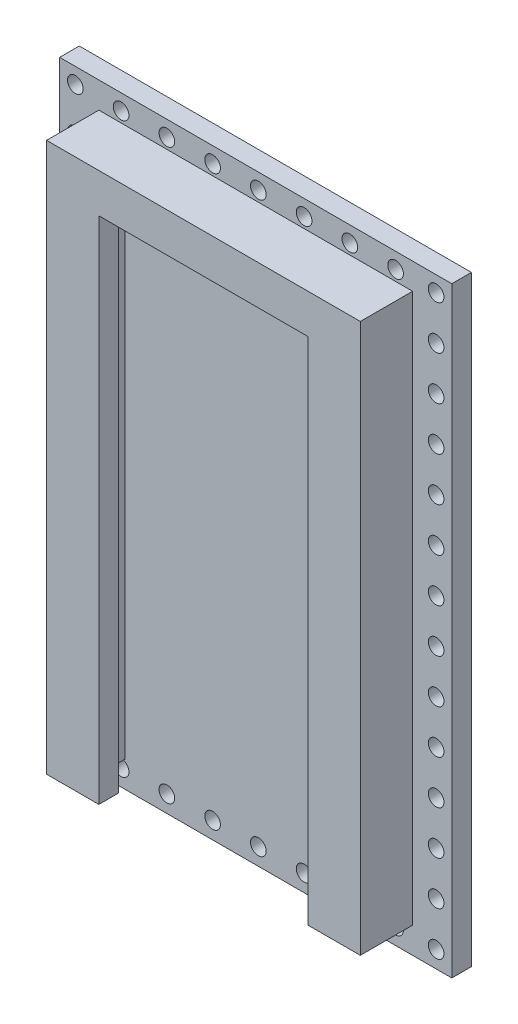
ISO-10303-21;
HEADER;
FILE_DESCRIPTION(('STEP AP214'),'2;1');
FILE_NAME('part.step','',(''),(''),'','','');
FILE_SCHEMA(('AUTOMOTIVE_DESIGN { 1 0 10303 214 1 1 1 1 }'));
ENDSEC;
DATA;
#1=APPLICATION_CONTEXT('core data for automotive mechanical design processes');
#2=APPLICATION_PROTOCOL_DEFINITION('international standard','automotive_design',2000,#1);
#3=PRODUCT_CONTEXT('',#1,'mechanical');
#4=PRODUCT('Part','Part','',(#3));
#5=PRODUCT_RELATED_PRODUCT_CATEGORY('part','',(#4));
#6=PRODUCT_DEFINITION_FORMATION('','',#4);
#7=PRODUCT_DEFINITION_CONTEXT('part definition',#1,'design');
#8=PRODUCT_DEFINITION('design','',#6,#7);
#9=PRODUCT_DEFINITION_SHAPE('','',#8);
#10=(LENGTH_UNIT() NAMED_UNIT(*) SI_UNIT(.MILLI.,.METRE.));
#11=(NAMED_UNIT(*) PLANE_ANGLE_UNIT() SI_UNIT($,.RADIAN.));
#12=(NAMED_UNIT(*) SI_UNIT($,.STERADIAN.) SOLID_ANGLE_UNIT());
#13=UNCERTAINTY_MEASURE_WITH_UNIT(LENGTH_MEASURE(1.E-05),#10,'distance_accuracy_value','');
#14=(GEOMETRIC_REPRESENTATION_CONTEXT(3) GLOBAL_UNCERTAINTY_ASSIGNED_CONTEXT((#13)) GLOBAL_UNIT_ASSIGNED_CONTEXT((#10,
#11,#12)) REPRESENTATION_CONTEXT('',''));
#15=CARTESIAN_POINT('',(0.,0.,0.));
#16=DIRECTION('',(0.,0.,1.));
#17=DIRECTION('',(1.,0.,0.));
#18=AXIS2_PLACEMENT_3D('',#15,#16,#17);
#19=CARTESIAN_POINT('',(0.,0.,1.));
#20=DIRECTION('',(0.,0.,-1.));
#21=DIRECTION('',(-1.,0.,0.));
#22=AXIS2_PLACEMENT_3D('',#19,#20,#21);
#23=PLANE('',#22);
#24=DIRECTION('',(0.,1.,0.));
#25=VECTOR('',#24,1.);
#26=CARTESIAN_POINT('',(15.,-23.,1.));
#27=LINE('',#26,#25);
#28=CARTESIAN_POINT('',(15.,-23.,1.));
#29=VERTEX_POINT('',#28);
#30=CARTESIAN_POINT('',(15.,23.,1.));
#31=VERTEX_POINT('',#30);
#32=EDGE_CURVE('E618',#29,#31,#27,.T.);
#33=ORIENTED_EDGE('',*,*,#32,.T.);
#34=DIRECTION('',(-1.,0.,0.));
#35=VECTOR('',#34,1.);
#36=CARTESIAN_POINT('',(-15.,23.,1.));
#37=LINE('',#36,#35);
#38=CARTESIAN_POINT('',(-15.,23.,1.));
#39=VERTEX_POINT('',#38);
#40=EDGE_CURVE('E622',#31,#39,#37,.T.);
#41=ORIENTED_EDGE('',*,*,#40,.T.);
#42=DIRECTION('',(0.,-1.,0.));
#43=VECTOR('',#42,1.);
#44=CARTESIAN_POINT('',(-15.,-23.,1.));
#45=LINE('',#44,#43);
#46=CARTESIAN_POINT('',(-15.,-23.,1.));
#47=VERTEX_POINT('',#46);
#48=EDGE_CURVE('E626',#39,#47,#45,.T.);
#49=ORIENTED_EDGE('',*,*,#48,.T.);
#50=DIRECTION('',(1.,0.,0.));
#51=VECTOR('',#50,1.);
#52=CARTESIAN_POINT('',(-15.,-23.,1.));
#53=LINE('',#52,#51);
#54=EDGE_CURVE('E630',#47,#29,#53,.T.);
#55=ORIENTED_EDGE('',*,*,#54,.T.);
#56=EDGE_LOOP('',(#33,#41,#49,#55));
#57=FACE_BOUND('',#56,.T.);
#58=CARTESIAN_POINT('',(-13.8,21.8,1.));
#59=DIRECTION('',(0.,0.,1.));
#60=DIRECTION('',(1.,0.,0.));
#61=AXIS2_PLACEMENT_3D('',#58,#59,#60);
#62=CIRCLE('',#61,0.6);
#63=CARTESIAN_POINT('',(-13.2,21.8,1.));
#64=VERTEX_POINT('',#63);
#65=EDGE_CURVE('E419',#64,#64,#62,.T.);
#66=ORIENTED_EDGE('',*,*,#65,.F.);
#67=EDGE_LOOP('',(#66));
#68=FACE_BOUND('',#67,.T.);
#69=CARTESIAN_POINT('',(7.2,-21.7,1.));
#70=DIRECTION('',(0.,0.,1.));
#71=DIRECTION('',(1.,0.,0.));
#72=AXIS2_PLACEMENT_3D('',#69,#70,#71);
#73=CIRCLE('',#72,0.6);
#74=CARTESIAN_POINT('',(7.8,-21.7,1.));
#75=VERTEX_POINT('',#74);
#76=EDGE_CURVE('E286',#75,#75,#73,.T.);
#77=ORIENTED_EDGE('',*,*,#76,.F.);
#78=EDGE_LOOP('',(#77));
#79=FACE_BOUND('',#78,.T.);
#80=CARTESIAN_POINT('',(3.7,-21.7,1.));
#81=DIRECTION('',(0.,0.,1.));
#82=DIRECTION('',(1.,0.,0.));
#83=AXIS2_PLACEMENT_3D('',#80,#81,#82);
#84=CIRCLE('',#83,0.6);
#85=CARTESIAN_POINT('',(4.3,-21.7,1.));
#86=VERTEX_POINT('',#85);
#87=EDGE_CURVE('E296',#86,#86,#84,.T.);
#88=ORIENTED_EDGE('',*,*,#87,.F.);
#89=EDGE_LOOP('',(#88));
#90=FACE_BOUND('',#89,.T.);
#91=CARTESIAN_POINT('',(0.199999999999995,-21.7,1.));
#92=DIRECTION('',(0.,0.,1.));
#93=DIRECTION('',(1.,0.,0.));
#94=AXIS2_PLACEMENT_3D('',#91,#92,#93);
#95=CIRCLE('',#94,0.6);
#96=CARTESIAN_POINT('',(0.799999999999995,-21.7,1.));
#97=VERTEX_POINT('',#96);
#98=EDGE_CURVE('E292',#97,#97,#95,.T.);
#99=ORIENTED_EDGE('',*,*,#98,.F.);
#100=EDGE_LOOP('',(#99));
#101=FACE_BOUND('',#100,.T.);
#102=CARTESIAN_POINT('',(-3.3,-21.7,1.));
#103=DIRECTION('',(0.,0.,1.));
#104=DIRECTION('',(1.,0.,0.));
#105=AXIS2_PLACEMENT_3D('',#102,#103,#104);
#106=CIRCLE('',#105,0.6);
#107=CARTESIAN_POINT('',(-2.7,-21.7,1.));
#108=VERTEX_POINT('',#107);
#109=EDGE_CURVE('E287',#108,#108,#106,.T.);
#110=ORIENTED_EDGE('',*,*,#109,.F.);
#111=EDGE_LOOP('',(#110));
#112=FACE_BOUND('',#111,.T.);
#113=CARTESIAN_POINT('',(-6.80000000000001,-21.7,1.));
#114=DIRECTION('',(0.,0.,1.));
#115=DIRECTION('',(1.,0.,0.));
#116=AXIS2_PLACEMENT_3D('',#113,#114,#115);
#117=CIRCLE('',#116,0.6);
#118=CARTESIAN_POINT('',(-6.2,-21.7,1.));
#119=VERTEX_POINT('',#118);
#120=EDGE_CURVE('E291',#119,#119,#117,.T.);
#121=ORIENTED_EDGE('',*,*,#120,.F.);
#122=EDGE_LOOP('',(#121));
#123=FACE_BOUND('',#122,.T.);
#124=CARTESIAN_POINT('',(-10.3,-21.7,1.));
#125=DIRECTION('',(0.,0.,1.));
#126=DIRECTION('',(1.,0.,0.));
#127=AXIS2_PLACEMENT_3D('',#124,#125,#126);
#128=CIRCLE('',#127,0.6);
#129=CARTESIAN_POINT('',(-9.7,-21.7,1.));
#130=VERTEX_POINT('',#129);
#131=EDGE_CURVE('E312',#130,#130,#128,.T.);
#132=ORIENTED_EDGE('',*,*,#131,.F.);
#133=EDGE_LOOP('',(#132));
#134=FACE_BOUND('',#133,.T.);
#135=CARTESIAN_POINT('',(10.7,21.8,1.));
#136=DIRECTION('',(0.,0.,1.));
#137=DIRECTION('',(1.,0.,0.));
#138=AXIS2_PLACEMENT_3D('',#135,#136,#137);
#139=CIRCLE('',#138,0.6);
#140=CARTESIAN_POINT('',(11.3,21.8,1.));
#141=VERTEX_POINT('',#140);
#142=EDGE_CURVE('E308',#141,#141,#139,.T.);
#143=ORIENTED_EDGE('',*,*,#142,.F.);
#144=EDGE_LOOP('',(#143));
#145=FACE_BOUND('',#144,.T.);
#146=CARTESIAN_POINT('',(7.2,21.8,1.));
#147=DIRECTION('',(0.,0.,1.));
#148=DIRECTION('',(1.,0.,0.));
#149=AXIS2_PLACEMENT_3D('',#146,#147,#148);
#150=CIRCLE('',#149,0.6);
#151=CARTESIAN_POINT('',(7.8,21.8,1.));
#152=VERTEX_POINT('',#151);
#153=EDGE_CURVE('E303',#152,#152,#150,.T.);
#154=ORIENTED_EDGE('',*,*,#153,.F.);
#155=EDGE_LOOP('',(#154));
#156=FACE_BOUND('',#155,.T.);
#157=CARTESIAN_POINT('',(10.7,-21.7,1.));
#158=DIRECTION('',(0.,0.,1.));
#159=DIRECTION('',(1.,0.,0.));
#160=AXIS2_PLACEMENT_3D('',#157,#158,#159);
#161=CIRCLE('',#160,0.6);
#162=CARTESIAN_POINT('',(11.3,-21.7,1.));
#163=VERTEX_POINT('',#162);
#164=EDGE_CURVE('E282',#163,#163,#161,.T.);
#165=ORIENTED_EDGE('',*,*,#164,.F.);
#166=EDGE_LOOP('',(#165));
#167=FACE_BOUND('',#166,.T.);
#168=CARTESIAN_POINT('',(-13.8,-8.31538461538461,1.));
#169=DIRECTION('',(0.,0.,1.));
#170=DIRECTION('',(1.,0.,0.));
#171=AXIS2_PLACEMENT_3D('',#168,#169,#170);
#172=CIRCLE('',#171,0.6);
#173=CARTESIAN_POINT('',(-13.2,-8.31538461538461,1.));
#174=VERTEX_POINT('',#173);
#175=EDGE_CURVE('E399',#174,#174,#172,.T.);
#176=ORIENTED_EDGE('',*,*,#175,.F.);
#177=EDGE_LOOP('',(#176));
#178=FACE_BOUND('',#177,.T.);
#179=CARTESIAN_POINT('',(-13.8,-11.6615384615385,1.));
#180=DIRECTION('',(0.,0.,1.));
#181=DIRECTION('',(1.,0.,0.));
#182=AXIS2_PLACEMENT_3D('',#179,#180,#181);
#183=CIRCLE('',#182,0.6);
#184=CARTESIAN_POINT('',(-13.2,-11.6615384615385,1.));
#185=VERTEX_POINT('',#184);
#186=EDGE_CURVE('E404',#185,#185,#183,.T.);
#187=ORIENTED_EDGE('',*,*,#186,.F.);
#188=EDGE_LOOP('',(#187));
#189=FACE_BOUND('',#188,.T.);
#190=CARTESIAN_POINT('',(-13.8,-15.0076923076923,1.));
#191=DIRECTION('',(0.,0.,1.));
#192=DIRECTION('',(1.,0.,0.));
#193=AXIS2_PLACEMENT_3D('',#190,#191,#192);
#194=CIRCLE('',#193,0.6);
#195=CARTESIAN_POINT('',(-13.2,-15.0076923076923,1.));
#196=VERTEX_POINT('',#195);
#197=EDGE_CURVE('E408',#196,#196,#194,.T.);
#198=ORIENTED_EDGE('',*,*,#197,.F.);
#199=EDGE_LOOP('',(#198));
#200=FACE_BOUND('',#199,.T.);
#201=CARTESIAN_POINT('',(-13.8,-18.3538461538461,1.));
#202=DIRECTION('',(0.,0.,1.));
#203=DIRECTION('',(1.,0.,0.));
#204=AXIS2_PLACEMENT_3D('',#201,#202,#203);
#205=CIRCLE('',#204,0.6);
#206=CARTESIAN_POINT('',(-13.2,-18.3538461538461,1.));
#207=VERTEX_POINT('',#206);
#208=EDGE_CURVE('E395',#207,#207,#205,.T.);
#209=ORIENTED_EDGE('',*,*,#208,.F.);
#210=EDGE_LOOP('',(#209));
#211=FACE_BOUND('',#210,.T.);
#212=CARTESIAN_POINT('',(13.8,15.1076923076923,1.));
#213=DIRECTION('',(0.,0.,1.));
#214=DIRECTION('',(1.,0.,0.));
#215=AXIS2_PLACEMENT_3D('',#212,#213,#214);
#216=CIRCLE('',#215,0.6);
#217=CARTESIAN_POINT('',(14.4,15.1076923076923,1.));
#218=VERTEX_POINT('',#217);
#219=EDGE_CURVE('E355',#218,#218,#216,.T.);
#220=ORIENTED_EDGE('',*,*,#219,.F.);
#221=EDGE_LOOP('',(#220));
#222=FACE_BOUND('',#221,.T.);
#223=CARTESIAN_POINT('',(13.8,18.4538461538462,1.));
#224=DIRECTION('',(0.,0.,1.));
#225=DIRECTION('',(1.,0.,0.));
#226=AXIS2_PLACEMENT_3D('',#223,#224,#225);
#227=CIRCLE('',#226,0.6);
#228=CARTESIAN_POINT('',(14.4,18.4538461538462,1.));
#229=VERTEX_POINT('',#228);
#230=EDGE_CURVE('E383',#229,#229,#227,.T.);
#231=ORIENTED_EDGE('',*,*,#230,.F.);
#232=EDGE_LOOP('',(#231));
#233=FACE_BOUND('',#232,.T.);
#234=CARTESIAN_POINT('',(13.8,21.8,1.));
#235=DIRECTION('',(0.,0.,1.));
#236=DIRECTION('',(1.,0.,0.));
#237=AXIS2_PLACEMENT_3D('',#234,#235,#236);
#238=CIRCLE('',#237,0.6);
#239=CARTESIAN_POINT('',(14.4,21.8,1.));
#240=VERTEX_POINT('',#239);
#241=EDGE_CURVE('E387',#240,#240,#238,.T.);
#242=ORIENTED_EDGE('',*,*,#241,.F.);
#243=EDGE_LOOP('',(#242));
#244=FACE_BOUND('',#243,.T.);
#245=CARTESIAN_POINT('',(-13.8,-21.7,1.));
#246=DIRECTION('',(0.,0.,1.));
#247=DIRECTION('',(1.,0.,0.));
#248=AXIS2_PLACEMENT_3D('',#245,#246,#247);
#249=CIRCLE('',#248,0.6);
#250=CARTESIAN_POINT('',(-13.2,-21.7,1.));
#251=VERTEX_POINT('',#250);
#252=EDGE_CURVE('E391',#251,#251,#249,.T.);
#253=ORIENTED_EDGE('',*,*,#252,.F.);
#254=EDGE_LOOP('',(#253));
#255=FACE_BOUND('',#254,.T.);
#256=CARTESIAN_POINT('',(-13.8,-4.96923076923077,1.));
#257=DIRECTION('',(0.,0.,1.));
#258=DIRECTION('',(1.,0.,0.));
#259=AXIS2_PLACEMENT_3D('',#256,#257,#258);
#260=CIRCLE('',#259,0.6);
#261=CARTESIAN_POINT('',(-13.2,-4.96923076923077,1.));
#262=VERTEX_POINT('',#261);
#263=EDGE_CURVE('E403',#262,#262,#260,.T.);
#264=ORIENTED_EDGE('',*,*,#263,.F.);
#265=EDGE_LOOP('',(#264));
#266=FACE_BOUND('',#265,.T.);
#267=CARTESIAN_POINT('',(-13.8,-1.62307692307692,1.));
#268=DIRECTION('',(0.,0.,1.));
#269=DIRECTION('',(1.,0.,0.));
#270=AXIS2_PLACEMENT_3D('',#267,#268,#269);
#271=CIRCLE('',#270,0.6);
#272=CARTESIAN_POINT('',(-13.2,-1.62307692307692,1.));
#273=VERTEX_POINT('',#272);
#274=EDGE_CURVE('E440',#273,#273,#271,.T.);
#275=ORIENTED_EDGE('',*,*,#274,.F.);
#276=EDGE_LOOP('',(#275));
#277=FACE_BOUND('',#276,.T.);
#278=CARTESIAN_POINT('',(-13.8,1.72307692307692,1.));
#279=DIRECTION('',(0.,0.,1.));
#280=DIRECTION('',(1.,0.,0.));
#281=AXIS2_PLACEMENT_3D('',#278,#279,#280);
#282=CIRCLE('',#281,0.6);
#283=CARTESIAN_POINT('',(-13.2,1.72307692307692,1.));
#284=VERTEX_POINT('',#283);
#285=EDGE_CURVE('E436',#284,#284,#282,.T.);
#286=ORIENTED_EDGE('',*,*,#285,.F.);
#287=EDGE_LOOP('',(#286));
#288=FACE_BOUND('',#287,.T.);
#289=CARTESIAN_POINT('',(-13.8,5.06923076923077,1.));
#290=DIRECTION('',(0.,0.,1.));
#291=DIRECTION('',(1.,0.,0.));
#292=AXIS2_PLACEMENT_3D('',#289,#290,#291);
#293=CIRCLE('',#292,0.6);
#294=CARTESIAN_POINT('',(-13.2,5.06923076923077,1.));
#295=VERTEX_POINT('',#294);
#296=EDGE_CURVE('E432',#295,#295,#293,.T.);
#297=ORIENTED_EDGE('',*,*,#296,.F.);
#298=EDGE_LOOP('',(#297));
#299=FACE_BOUND('',#298,.T.);
#300=CARTESIAN_POINT('',(-13.8,8.41538461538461,1.));
#301=DIRECTION('',(0.,0.,1.));
#302=DIRECTION('',(1.,0.,0.));
#303=AXIS2_PLACEMENT_3D('',#300,#301,#302);
#304=CIRCLE('',#303,0.6);
#305=CARTESIAN_POINT('',(-13.2,8.41538461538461,1.));
#306=VERTEX_POINT('',#305);
#307=EDGE_CURVE('E428',#306,#306,#304,.T.);
#308=ORIENTED_EDGE('',*,*,#307,.F.);
#309=EDGE_LOOP('',(#308));
#310=FACE_BOUND('',#309,.T.);
#311=CARTESIAN_POINT('',(-13.8,11.7615384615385,1.));
#312=DIRECTION('',(0.,0.,1.));
#313=DIRECTION('',(1.,0.,0.));
#314=AXIS2_PLACEMENT_3D('',#311,#312,#313);
#315=CIRCLE('',#314,0.6);
#316=CARTESIAN_POINT('',(-13.2,11.7615384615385,1.));
#317=VERTEX_POINT('',#316);
#318=EDGE_CURVE('E424',#317,#317,#315,.T.);
#319=ORIENTED_EDGE('',*,*,#318,.F.);
#320=EDGE_LOOP('',(#319));
#321=FACE_BOUND('',#320,.T.);
#322=CARTESIAN_POINT('',(-13.8,15.1076923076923,1.));
#323=DIRECTION('',(0.,0.,1.));
#324=DIRECTION('',(1.,0.,0.));
#325=AXIS2_PLACEMENT_3D('',#322,#323,#324);
#326=CIRCLE('',#325,0.6);
#327=CARTESIAN_POINT('',(-13.2,15.1076923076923,1.));
#328=VERTEX_POINT('',#327);
#329=EDGE_CURVE('E420',#328,#328,#326,.T.);
#330=ORIENTED_EDGE('',*,*,#329,.F.);
#331=EDGE_LOOP('',(#330));
#332=FACE_BOUND('',#331,.T.);
#333=CARTESIAN_POINT('',(-13.8,18.4538461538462,1.));
#334=DIRECTION('',(0.,0.,1.));
#335=DIRECTION('',(1.,0.,0.));
#336=AXIS2_PLACEMENT_3D('',#333,#334,#335);
#337=CIRCLE('',#336,0.6);
#338=CARTESIAN_POINT('',(-13.2,18.4538461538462,1.));
#339=VERTEX_POINT('',#338);
#340=EDGE_CURVE('E415',#339,#339,#337,.T.);
#341=ORIENTED_EDGE('',*,*,#340,.F.);
#342=EDGE_LOOP('',(#341));
#343=FACE_BOUND('',#342,.T.);
#344=CARTESIAN_POINT('',(-10.3,21.8,1.));
#345=DIRECTION('',(0.,0.,1.));
#346=DIRECTION('',(1.,0.,0.));
#347=AXIS2_PLACEMENT_3D('',#344,#345,#346);
#348=CIRCLE('',#347,0.6);
#349=CARTESIAN_POINT('',(-9.7,21.8,1.));
#350=VERTEX_POINT('',#349);
#351=EDGE_CURVE('E323',#350,#350,#348,.T.);
#352=ORIENTED_EDGE('',*,*,#351,.F.);
#353=EDGE_LOOP('',(#352));
#354=FACE_BOUND('',#353,.T.);
#355=CARTESIAN_POINT('',(13.8,-21.7,1.));
#356=DIRECTION('',(0.,0.,1.));
#357=DIRECTION('',(1.,0.,0.));
#358=AXIS2_PLACEMENT_3D('',#355,#356,#357);
#359=CIRCLE('',#358,0.6);
#360=CARTESIAN_POINT('',(14.4,-21.7,1.));
#361=VERTEX_POINT('',#360);
#362=EDGE_CURVE('E335',#361,#361,#359,.T.);
#363=ORIENTED_EDGE('',*,*,#362,.F.);
#364=EDGE_LOOP('',(#363));
#365=FACE_BOUND('',#364,.T.);
#366=CARTESIAN_POINT('',(13.8,-18.3538461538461,1.));
#367=DIRECTION('',(0.,0.,1.));
#368=DIRECTION('',(1.,0.,0.));
#369=AXIS2_PLACEMENT_3D('',#366,#367,#368);
#370=CIRCLE('',#369,0.6);
#371=CARTESIAN_POINT('',(14.4,-18.3538461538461,1.));
#372=VERTEX_POINT('',#371);
#373=EDGE_CURVE('E339',#372,#372,#370,.T.);
#374=ORIENTED_EDGE('',*,*,#373,.F.);
#375=EDGE_LOOP('',(#374));
#376=FACE_BOUND('',#375,.T.);
#377=CARTESIAN_POINT('',(13.8,-15.0076923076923,1.));
#378=DIRECTION('',(0.,0.,1.));
#379=DIRECTION('',(1.,0.,0.));
#380=AXIS2_PLACEMENT_3D('',#377,#378,#379);
#381=CIRCLE('',#380,0.6);
#382=CARTESIAN_POINT('',(14.4,-15.0076923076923,1.));
#383=VERTEX_POINT('',#382);
#384=EDGE_CURVE('E343',#383,#383,#381,.T.);
#385=ORIENTED_EDGE('',*,*,#384,.F.);
#386=EDGE_LOOP('',(#385));
#387=FACE_BOUND('',#386,.T.);
#388=CARTESIAN_POINT('',(-6.80000000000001,21.8,1.));
#389=DIRECTION('',(0.,0.,1.));
#390=DIRECTION('',(1.,0.,0.));
#391=AXIS2_PLACEMENT_3D('',#388,#389,#390);
#392=CIRCLE('',#391,0.6);
#393=CARTESIAN_POINT('',(-6.2,21.8,1.));
#394=VERTEX_POINT('',#393);
#395=EDGE_CURVE('E319',#394,#394,#392,.T.);
#396=ORIENTED_EDGE('',*,*,#395,.F.);
#397=EDGE_LOOP('',(#396));
#398=FACE_BOUND('',#397,.T.);
#399=CARTESIAN_POINT('',(-3.3,21.8,1.));
#400=DIRECTION('',(0.,0.,1.));
#401=DIRECTION('',(1.,0.,0.));
#402=AXIS2_PLACEMENT_3D('',#399,#400,#401);
#403=CIRCLE('',#402,0.6);
#404=CARTESIAN_POINT('',(-2.7,21.8,1.));
#405=VERTEX_POINT('',#404);
#406=EDGE_CURVE('E324',#405,#405,#403,.T.);
#407=ORIENTED_EDGE('',*,*,#406,.F.);
#408=EDGE_LOOP('',(#407));
#409=FACE_BOUND('',#408,.T.);
#410=CARTESIAN_POINT('',(0.199999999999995,21.8,1.));
#411=DIRECTION('',(0.,0.,1.));
#412=DIRECTION('',(1.,0.,0.));
#413=AXIS2_PLACEMENT_3D('',#410,#411,#412);
#414=CIRCLE('',#413,0.6);
#415=CARTESIAN_POINT('',(0.799999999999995,21.8,1.));
#416=VERTEX_POINT('',#415);
#417=EDGE_CURVE('E328',#416,#416,#414,.T.);
#418=ORIENTED_EDGE('',*,*,#417,.F.);
#419=EDGE_LOOP('',(#418));
#420=FACE_BOUND('',#419,.T.);
#421=CARTESIAN_POINT('',(3.7,21.8,1.));
#422=DIRECTION('',(0.,0.,1.));
#423=DIRECTION('',(1.,0.,0.));
#424=AXIS2_PLACEMENT_3D('',#421,#422,#423);
#425=CIRCLE('',#424,0.6);
#426=CARTESIAN_POINT('',(4.3,21.8,1.));
#427=VERTEX_POINT('',#426);
#428=EDGE_CURVE('E307',#427,#427,#425,.T.);
#429=ORIENTED_EDGE('',*,*,#428,.F.);
#430=EDGE_LOOP('',(#429));
#431=FACE_BOUND('',#430,.T.);
#432=CARTESIAN_POINT('',(13.8,-11.6615384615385,1.));
#433=DIRECTION('',(0.,0.,1.));
#434=DIRECTION('',(1.,0.,0.));
#435=AXIS2_PLACEMENT_3D('',#432,#433,#434);
#436=CIRCLE('',#435,0.6);
#437=CARTESIAN_POINT('',(14.4,-11.6615384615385,1.));
#438=VERTEX_POINT('',#437);
#439=EDGE_CURVE('E347',#438,#438,#436,.T.);
#440=ORIENTED_EDGE('',*,*,#439,.F.);
#441=EDGE_LOOP('',(#440));
#442=FACE_BOUND('',#441,.T.);
#443=CARTESIAN_POINT('',(13.8,-8.31538461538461,1.));
#444=DIRECTION('',(0.,0.,1.));
#445=DIRECTION('',(1.,0.,0.));
#446=AXIS2_PLACEMENT_3D('',#443,#444,#445);
#447=CIRCLE('',#446,0.6);
#448=CARTESIAN_POINT('',(14.4,-8.31538461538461,1.));
#449=VERTEX_POINT('',#448);
#450=EDGE_CURVE('E376',#449,#449,#447,.T.);
#451=ORIENTED_EDGE('',*,*,#450,.F.);
#452=EDGE_LOOP('',(#451));
#453=FACE_BOUND('',#452,.T.);
#454=CARTESIAN_POINT('',(13.8,-4.96923076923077,1.));
#455=DIRECTION('',(0.,0.,1.));
#456=DIRECTION('',(1.,0.,0.));
#457=AXIS2_PLACEMENT_3D('',#454,#455,#456);
#458=CIRCLE('',#457,0.6);
#459=CARTESIAN_POINT('',(14.4,-4.96923076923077,1.));
#460=VERTEX_POINT('',#459);
#461=EDGE_CURVE('E372',#460,#460,#458,.T.);
#462=ORIENTED_EDGE('',*,*,#461,.F.);
#463=EDGE_LOOP('',(#462));
#464=FACE_BOUND('',#463,.T.);
#465=CARTESIAN_POINT('',(13.8,-1.62307692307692,1.));
#466=DIRECTION('',(0.,0.,1.));
#467=DIRECTION('',(1.,0.,0.));
#468=AXIS2_PLACEMENT_3D('',#465,#466,#467);
#469=CIRCLE('',#468,0.6);
#470=CARTESIAN_POINT('',(14.4,-1.62307692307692,1.));
#471=VERTEX_POINT('',#470);
#472=EDGE_CURVE('E368',#471,#471,#469,.T.);
#473=ORIENTED_EDGE('',*,*,#472,.F.);
#474=EDGE_LOOP('',(#473));
#475=FACE_BOUND('',#474,.T.);
#476=CARTESIAN_POINT('',(13.8,1.72307692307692,1.));
#477=DIRECTION('',(0.,0.,1.));
#478=DIRECTION('',(1.,0.,0.));
#479=AXIS2_PLACEMENT_3D('',#476,#477,#478);
#480=CIRCLE('',#479,0.6);
#481=CARTESIAN_POINT('',(14.4,1.72307692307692,1.));
#482=VERTEX_POINT('',#481);
#483=EDGE_CURVE('E364',#482,#482,#480,.T.);
#484=ORIENTED_EDGE('',*,*,#483,.F.);
#485=EDGE_LOOP('',(#484));
#486=FACE_BOUND('',#485,.T.);
#487=CARTESIAN_POINT('',(13.8,5.06923076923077,1.));
#488=DIRECTION('',(0.,0.,1.));
#489=DIRECTION('',(1.,0.,0.));
#490=AXIS2_PLACEMENT_3D('',#487,#488,#489);
#491=CIRCLE('',#490,0.6);
#492=CARTESIAN_POINT('',(14.4,5.06923076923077,1.));
#493=VERTEX_POINT('',#492);
#494=EDGE_CURVE('E360',#493,#493,#491,.T.);
#495=ORIENTED_EDGE('',*,*,#494,.F.);
#496=EDGE_LOOP('',(#495));
#497=FACE_BOUND('',#496,.T.);
#498=CARTESIAN_POINT('',(13.8,8.41538461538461,1.));
#499=DIRECTION('',(0.,0.,1.));
#500=DIRECTION('',(1.,0.,0.));
#501=AXIS2_PLACEMENT_3D('',#498,#499,#500);
#502=CIRCLE('',#501,0.6);
#503=CARTESIAN_POINT('',(14.4,8.41538461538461,1.));
#504=VERTEX_POINT('',#503);
#505=EDGE_CURVE('E356',#504,#504,#502,.T.);
#506=ORIENTED_EDGE('',*,*,#505,.F.);
#507=EDGE_LOOP('',(#506));
#508=FACE_BOUND('',#507,.T.);
#509=CARTESIAN_POINT('',(13.8,11.7615384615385,1.));
#510=DIRECTION('',(0.,0.,1.));
#511=DIRECTION('',(1.,0.,0.));
#512=AXIS2_PLACEMENT_3D('',#509,#510,#511);
#513=CIRCLE('',#512,0.6);
#514=CARTESIAN_POINT('',(14.4,11.7615384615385,1.));
#515=VERTEX_POINT('',#514);
#516=EDGE_CURVE('E351',#515,#515,#513,.T.);
#517=ORIENTED_EDGE('',*,*,#516,.F.);
#518=EDGE_LOOP('',(#517));
#519=FACE_BOUND('',#518,.T.);
#520=DIRECTION('',(1.,0.,0.));
#521=VECTOR('',#520,1.);
#522=CARTESIAN_POINT('',(8.00000000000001,-21.,1.));
#523=LINE('',#522,#521);
#524=CARTESIAN_POINT('',(10.,-21.,1.));
#525=VERTEX_POINT('',#524);
#526=CARTESIAN_POINT('',(12.,-21.,1.));
#527=VERTEX_POINT('',#526);
#528=EDGE_CURVE('E214',#525,#527,#523,.T.);
#529=ORIENTED_EDGE('',*,*,#528,.F.);
#530=DIRECTION('',(0.,-1.,0.));
#531=VECTOR('',#530,1.);
#532=CARTESIAN_POINT('',(9.99999999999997,38.1556443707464,1.));
#533=LINE('',#532,#531);
#534=CARTESIAN_POINT('',(10.,18.,1.));
#535=VERTEX_POINT('',#534);
#536=EDGE_CURVE('E63',#535,#525,#533,.T.);
#537=ORIENTED_EDGE('',*,*,#536,.F.);
#538=DIRECTION('',(1.,0.,0.));
#539=VECTOR('',#538,1.);
#540=CARTESIAN_POINT('',(-8.,18.,1.));
#541=LINE('',#540,#539);
#542=CARTESIAN_POINT('',(-10.,18.,1.));
#543=VERTEX_POINT('',#542);
#544=EDGE_CURVE('E249',#543,#535,#541,.T.);
#545=ORIENTED_EDGE('',*,*,#544,.F.);
#546=DIRECTION('',(0.,-1.,0.));
#547=VECTOR('',#546,1.);
#548=CARTESIAN_POINT('',(-10.,38.1556443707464,1.));
#549=LINE('',#548,#547);
#550=CARTESIAN_POINT('',(-9.99999999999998,-21.,1.));
#551=VERTEX_POINT('',#550);
#552=EDGE_CURVE('E184',#543,#551,#549,.T.);
#553=ORIENTED_EDGE('',*,*,#552,.T.);
#554=DIRECTION('',(1.,0.,0.));
#555=VECTOR('',#554,1.);
#556=CARTESIAN_POINT('',(-12.,-21.,1.));
#557=LINE('',#556,#555);
#558=CARTESIAN_POINT('',(-12.,-21.,1.));
#559=VERTEX_POINT('',#558);
#560=EDGE_CURVE('E245',#559,#551,#557,.T.);
#561=ORIENTED_EDGE('',*,*,#560,.F.);
#562=DIRECTION('',(0.,-1.,0.));
#563=VECTOR('',#562,1.);
#564=CARTESIAN_POINT('',(-12.,-21.,1.));
#565=LINE('',#564,#563);
#566=CARTESIAN_POINT('',(-12.,21.,1.));
#567=VERTEX_POINT('',#566);
#568=EDGE_CURVE('E241',#567,#559,#565,.T.);
#569=ORIENTED_EDGE('',*,*,#568,.F.);
#570=DIRECTION('',(-1.,0.,0.));
#571=VECTOR('',#570,1.);
#572=CARTESIAN_POINT('',(-12.,21.,1.));
#573=LINE('',#572,#571);
#574=CARTESIAN_POINT('',(12.,21.,1.));
#575=VERTEX_POINT('',#574);
#576=EDGE_CURVE('E71',#575,#567,#573,.T.);
#577=ORIENTED_EDGE('',*,*,#576,.F.);
#578=DIRECTION('',(0.,1.,0.));
#579=VECTOR('',#578,1.);
#580=CARTESIAN_POINT('',(12.,-21.,1.));
#581=LINE('',#580,#579);
#582=EDGE_CURVE('E208',#527,#575,#581,.T.);
#583=ORIENTED_EDGE('',*,*,#582,.F.);
#584=EDGE_LOOP('',(#529,#537,#545,#553,#561,#569,#577,#583));
#585=FACE_BOUND('',#584,.T.);
#586=ADVANCED_FACE('F45',(#57,#68,#79,#90,#101,#112,#123,#134,#145,#156,#167,#178,#189,#200,
#211,#222,#233,#244,#255,#266,#277,#288,#299,#310,#321,#332,#343,#354,#365,#376,#387,#398,#409,
#420,#431,#442,#453,#464,#475,#486,#497,#508,#519,#585),#23,.F.);
#587=CARTESIAN_POINT('',(15.,-23.,-0.5));
#588=DIRECTION('',(1.,0.,0.));
#589=DIRECTION('',(0.,0.,-1.));
#590=AXIS2_PLACEMENT_3D('',#587,#588,#589);
#591=PLANE('',#590);
#592=DIRECTION('',(0.,0.,1.));
#593=VECTOR('',#592,1.);
#594=CARTESIAN_POINT('',(15.,23.,-0.5));
#595=LINE('',#594,#593);
#596=CARTESIAN_POINT('',(15.,23.,-0.5));
#597=VERTEX_POINT('',#596);
#598=EDGE_CURVE('E49',#597,#31,#595,.T.);
#599=ORIENTED_EDGE('',*,*,#598,.T.);
#600=ORIENTED_EDGE('',*,*,#32,.F.);
#601=DIRECTION('',(0.,0.,1.));
#602=VECTOR('',#601,1.);
#603=CARTESIAN_POINT('',(15.,-23.,-0.5));
#604=LINE('',#603,#602);
#605=CARTESIAN_POINT('',(15.,-23.,-0.5));
#606=VERTEX_POINT('',#605);
#607=EDGE_CURVE('E11',#606,#29,#604,.T.);
#608=ORIENTED_EDGE('',*,*,#607,.F.);
#609=DIRECTION('',(0.,1.,0.));
#610=VECTOR('',#609,1.);
#611=CARTESIAN_POINT('',(15.,-23.,-0.5));
#612=LINE('',#611,#610);
#613=EDGE_CURVE('E634',#606,#597,#612,.T.);
#614=ORIENTED_EDGE('',*,*,#613,.T.);
#615=EDGE_LOOP('',(#599,#600,#608,#614));
#616=FACE_BOUND('',#615,.T.);
#617=ADVANCED_FACE('F47',(#616),#591,.T.);
#618=CARTESIAN_POINT('',(-15.,-23.,-0.5));
#619=DIRECTION('',(0.,-1.,0.));
#620=DIRECTION('',(0.,0.,-1.));
#621=AXIS2_PLACEMENT_3D('',#618,#619,#620);
#622=PLANE('',#621);
#623=ORIENTED_EDGE('',*,*,#607,.T.);
#624=ORIENTED_EDGE('',*,*,#54,.F.);
#625=DIRECTION('',(0.,0.,1.));
#626=VECTOR('',#625,1.);
#627=CARTESIAN_POINT('',(-15.,-23.,-0.5));
#628=LINE('',#627,#626);
#629=CARTESIAN_POINT('',(-15.,-23.,-0.5));
#630=VERTEX_POINT('',#629);
#631=EDGE_CURVE('E55',#630,#47,#628,.T.);
#632=ORIENTED_EDGE('',*,*,#631,.F.);
#633=DIRECTION('',(1.,0.,0.));
#634=VECTOR('',#633,1.);
#635=CARTESIAN_POINT('',(-15.,-23.,-0.5));
#636=LINE('',#635,#634);
#637=EDGE_CURVE('E646',#630,#606,#636,.T.);
#638=ORIENTED_EDGE('',*,*,#637,.T.);
#639=EDGE_LOOP('',(#623,#624,#632,#638));
#640=FACE_BOUND('',#639,.T.);
#641=ADVANCED_FACE('F666',(#640),#622,.T.);
#642=CARTESIAN_POINT('',(-15.,-23.,-0.5));
#643=DIRECTION('',(-1.,0.,0.));
#644=DIRECTION('',(0.,0.,1.));
#645=AXIS2_PLACEMENT_3D('',#642,#643,#644);
#646=PLANE('',#645);
#647=ORIENTED_EDGE('',*,*,#631,.T.);
#648=ORIENTED_EDGE('',*,*,#48,.F.);
#649=DIRECTION('',(0.,0.,1.));
#650=VECTOR('',#649,1.);
#651=CARTESIAN_POINT('',(-15.,23.,-0.5));
#652=LINE('',#651,#650);
#653=CARTESIAN_POINT('',(-15.,23.,-0.5));
#654=VERTEX_POINT('',#653);
#655=EDGE_CURVE('E651',#654,#39,#652,.T.);
#656=ORIENTED_EDGE('',*,*,#655,.F.);
#657=DIRECTION('',(0.,-1.,0.));
#658=VECTOR('',#657,1.);
#659=CARTESIAN_POINT('',(-15.,-23.,-0.5));
#660=LINE('',#659,#658);
#661=EDGE_CURVE('E642',#654,#630,#660,.T.);
#662=ORIENTED_EDGE('',*,*,#661,.T.);
#663=EDGE_LOOP('',(#647,#648,#656,#662));
#664=FACE_BOUND('',#663,.T.);
#665=ADVANCED_FACE('F672',(#664),#646,.T.);
#666=CARTESIAN_POINT('',(-15.,23.,-0.5));
#667=DIRECTION('',(0.,1.,0.));
#668=DIRECTION('',(0.,0.,1.));
#669=AXIS2_PLACEMENT_3D('',#666,#667,#668);
#670=PLANE('',#669);
#671=ORIENTED_EDGE('',*,*,#655,.T.);
#672=ORIENTED_EDGE('',*,*,#40,.F.);
#673=ORIENTED_EDGE('',*,*,#598,.F.);
#674=DIRECTION('',(-1.,0.,0.));
#675=VECTOR('',#674,1.);
#676=CARTESIAN_POINT('',(-15.,23.,-0.5));
#677=LINE('',#676,#675);
#678=EDGE_CURVE('E638',#597,#654,#677,.T.);
#679=ORIENTED_EDGE('',*,*,#678,.T.);
#680=EDGE_LOOP('',(#671,#672,#673,#679));
#681=FACE_BOUND('',#680,.T.);
#682=ADVANCED_FACE('F660',(#681),#670,.T.);
#683=CARTESIAN_POINT('',(0.,0.,-0.5));
#684=DIRECTION('',(0.,0.,-1.));
#685=DIRECTION('',(-1.,0.,0.));
#686=AXIS2_PLACEMENT_3D('',#683,#684,#685);
#687=PLANE('',#686);
#688=CARTESIAN_POINT('',(13.8,11.7615384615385,-0.5));
#689=DIRECTION('',(0.,0.,-1.));
#690=DIRECTION('',(-1.,0.,0.));
#691=AXIS2_PLACEMENT_3D('',#688,#689,#690);
#692=CIRCLE('',#691,0.6);
#693=CARTESIAN_POINT('',(13.2,11.7615384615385,-0.5));
#694=VERTEX_POINT('',#693);
#695=EDGE_CURVE('E614',#694,#694,#692,.T.);
#696=ORIENTED_EDGE('',*,*,#695,.F.);
#697=EDGE_LOOP('',(#696));
#698=FACE_BOUND('',#697,.T.);
#699=CARTESIAN_POINT('',(13.8,8.41538461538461,-0.5));
#700=DIRECTION('',(0.,0.,-1.));
#701=DIRECTION('',(-1.,0.,0.));
#702=AXIS2_PLACEMENT_3D('',#699,#700,#701);
#703=CIRCLE('',#702,0.6);
#704=CARTESIAN_POINT('',(13.2,8.41538461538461,-0.5));
#705=VERTEX_POINT('',#704);
#706=EDGE_CURVE('E610',#705,#705,#703,.T.);
#707=ORIENTED_EDGE('',*,*,#706,.F.);
#708=EDGE_LOOP('',(#707));
#709=FACE_BOUND('',#708,.T.);
#710=CARTESIAN_POINT('',(13.8,5.06923076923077,-0.5));
#711=DIRECTION('',(0.,0.,-1.));
#712=DIRECTION('',(-1.,0.,0.));
#713=AXIS2_PLACEMENT_3D('',#710,#711,#712);
#714=CIRCLE('',#713,0.6);
#715=CARTESIAN_POINT('',(13.2,5.06923076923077,-0.5));
#716=VERTEX_POINT('',#715);
#717=EDGE_CURVE('E606',#716,#716,#714,.T.);
#718=ORIENTED_EDGE('',*,*,#717,.F.);
#719=EDGE_LOOP('',(#718));
#720=FACE_BOUND('',#719,.T.);
#721=CARTESIAN_POINT('',(13.8,1.72307692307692,-0.5));
#722=DIRECTION('',(0.,0.,-1.));
#723=DIRECTION('',(-1.,0.,0.));
#724=AXIS2_PLACEMENT_3D('',#721,#722,#723);
#725=CIRCLE('',#724,0.6);
#726=CARTESIAN_POINT('',(13.2,1.72307692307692,-0.5));
#727=VERTEX_POINT('',#726);
#728=EDGE_CURVE('E602',#727,#727,#725,.T.);
#729=ORIENTED_EDGE('',*,*,#728,.F.);
#730=EDGE_LOOP('',(#729));
#731=FACE_BOUND('',#730,.T.);
#732=CARTESIAN_POINT('',(13.8,-1.62307692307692,-0.5));
#733=DIRECTION('',(0.,0.,-1.));
#734=DIRECTION('',(-1.,0.,0.));
#735=AXIS2_PLACEMENT_3D('',#732,#733,#734);
#736=CIRCLE('',#735,0.6);
#737=CARTESIAN_POINT('',(13.2,-1.62307692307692,-0.5));
#738=VERTEX_POINT('',#737);
#739=EDGE_CURVE('E598',#738,#738,#736,.T.);
#740=ORIENTED_EDGE('',*,*,#739,.F.);
#741=EDGE_LOOP('',(#740));
#742=FACE_BOUND('',#741,.T.);
#743=CARTESIAN_POINT('',(13.8,-4.96923076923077,-0.5));
#744=DIRECTION('',(0.,0.,-1.));
#745=DIRECTION('',(-1.,0.,0.));
#746=AXIS2_PLACEMENT_3D('',#743,#744,#745);
#747=CIRCLE('',#746,0.6);
#748=CARTESIAN_POINT('',(13.2,-4.96923076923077,-0.5));
#749=VERTEX_POINT('',#748);
#750=EDGE_CURVE('E594',#749,#749,#747,.T.);
#751=ORIENTED_EDGE('',*,*,#750,.F.);
#752=EDGE_LOOP('',(#751));
#753=FACE_BOUND('',#752,.T.);
#754=CARTESIAN_POINT('',(13.8,-8.31538461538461,-0.5));
#755=DIRECTION('',(0.,0.,-1.));
#756=DIRECTION('',(-1.,0.,0.));
#757=AXIS2_PLACEMENT_3D('',#754,#755,#756);
#758=CIRCLE('',#757,0.6);
#759=CARTESIAN_POINT('',(13.2,-8.31538461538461,-0.5));
#760=VERTEX_POINT('',#759);
#761=EDGE_CURVE('E590',#760,#760,#758,.T.);
#762=ORIENTED_EDGE('',*,*,#761,.F.);
#763=EDGE_LOOP('',(#762));
#764=FACE_BOUND('',#763,.T.);
#765=CARTESIAN_POINT('',(13.8,-11.6615384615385,-0.5));
#766=DIRECTION('',(0.,0.,-1.));
#767=DIRECTION('',(-1.,0.,0.));
#768=AXIS2_PLACEMENT_3D('',#765,#766,#767);
#769=CIRCLE('',#768,0.6);
#770=CARTESIAN_POINT('',(13.2,-11.6615384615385,-0.5));
#771=VERTEX_POINT('',#770);
#772=EDGE_CURVE('E586',#771,#771,#769,.T.);
#773=ORIENTED_EDGE('',*,*,#772,.F.);
#774=EDGE_LOOP('',(#773));
#775=FACE_BOUND('',#774,.T.);
#776=CARTESIAN_POINT('',(3.7,21.8,-0.5));
#777=DIRECTION('',(0.,0.,-1.));
#778=DIRECTION('',(-1.,0.,0.));
#779=AXIS2_PLACEMENT_3D('',#776,#777,#778);
#780=CIRCLE('',#779,0.6);
#781=CARTESIAN_POINT('',(3.1,21.8,-0.5));
#782=VERTEX_POINT('',#781);
#783=EDGE_CURVE('E582',#782,#782,#780,.T.);
#784=ORIENTED_EDGE('',*,*,#783,.F.);
#785=EDGE_LOOP('',(#784));
#786=FACE_BOUND('',#785,.T.);
#787=CARTESIAN_POINT('',(0.199999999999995,21.8,-0.5));
#788=DIRECTION('',(0.,0.,-1.));
#789=DIRECTION('',(-1.,0.,0.));
#790=AXIS2_PLACEMENT_3D('',#787,#788,#789);
#791=CIRCLE('',#790,0.6);
#792=CARTESIAN_POINT('',(-0.400000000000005,21.8,-0.5));
#793=VERTEX_POINT('',#792);
#794=EDGE_CURVE('E578',#793,#793,#791,.T.);
#795=ORIENTED_EDGE('',*,*,#794,.F.);
#796=EDGE_LOOP('',(#795));
#797=FACE_BOUND('',#796,.T.);
#798=CARTESIAN_POINT('',(-3.3,21.8,-0.5));
#799=DIRECTION('',(0.,0.,-1.));
#800=DIRECTION('',(-1.,0.,0.));
#801=AXIS2_PLACEMENT_3D('',#798,#799,#800);
#802=CIRCLE('',#801,0.6);
#803=CARTESIAN_POINT('',(-3.9,21.8,-0.5));
#804=VERTEX_POINT('',#803);
#805=EDGE_CURVE('E574',#804,#804,#802,.T.);
#806=ORIENTED_EDGE('',*,*,#805,.F.);
#807=EDGE_LOOP('',(#806));
#808=FACE_BOUND('',#807,.T.);
#809=CARTESIAN_POINT('',(-6.80000000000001,21.8,-0.5));
#810=DIRECTION('',(0.,0.,-1.));
#811=DIRECTION('',(-1.,0.,0.));
#812=AXIS2_PLACEMENT_3D('',#809,#810,#811);
#813=CIRCLE('',#812,0.6);
#814=CARTESIAN_POINT('',(-7.4,21.8,-0.5));
#815=VERTEX_POINT('',#814);
#816=EDGE_CURVE('E570',#815,#815,#813,.T.);
#817=ORIENTED_EDGE('',*,*,#816,.F.);
#818=EDGE_LOOP('',(#817));
#819=FACE_BOUND('',#818,.T.);
#820=CARTESIAN_POINT('',(13.8,-15.0076923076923,-0.5));
#821=DIRECTION('',(0.,0.,-1.));
#822=DIRECTION('',(-1.,0.,0.));
#823=AXIS2_PLACEMENT_3D('',#820,#821,#822);
#824=CIRCLE('',#823,0.6);
#825=CARTESIAN_POINT('',(13.2,-15.0076923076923,-0.5));
#826=VERTEX_POINT('',#825);
#827=EDGE_CURVE('E566',#826,#826,#824,.T.);
#828=ORIENTED_EDGE('',*,*,#827,.F.);
#829=EDGE_LOOP('',(#828));
#830=FACE_BOUND('',#829,.T.);
#831=CARTESIAN_POINT('',(13.8,-18.3538461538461,-0.5));
#832=DIRECTION('',(0.,0.,-1.));
#833=DIRECTION('',(-1.,0.,0.));
#834=AXIS2_PLACEMENT_3D('',#831,#832,#833);
#835=CIRCLE('',#834,0.6);
#836=CARTESIAN_POINT('',(13.2,-18.3538461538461,-0.5));
#837=VERTEX_POINT('',#836);
#838=EDGE_CURVE('E562',#837,#837,#835,.T.);
#839=ORIENTED_EDGE('',*,*,#838,.F.);
#840=EDGE_LOOP('',(#839));
#841=FACE_BOUND('',#840,.T.);
#842=CARTESIAN_POINT('',(13.8,-21.7,-0.5));
#843=DIRECTION('',(0.,0.,-1.));
#844=DIRECTION('',(-1.,0.,0.));
#845=AXIS2_PLACEMENT_3D('',#842,#843,#844);
#846=CIRCLE('',#845,0.6);
#847=CARTESIAN_POINT('',(13.2,-21.7,-0.5));
#848=VERTEX_POINT('',#847);
#849=EDGE_CURVE('E558',#848,#848,#846,.T.);
#850=ORIENTED_EDGE('',*,*,#849,.F.);
#851=EDGE_LOOP('',(#850));
#852=FACE_BOUND('',#851,.T.);
#853=CARTESIAN_POINT('',(-10.3,21.8,-0.5));
#854=DIRECTION('',(0.,0.,-1.));
#855=DIRECTION('',(-1.,0.,0.));
#856=AXIS2_PLACEMENT_3D('',#853,#854,#855);
#857=CIRCLE('',#856,0.6);
#858=CARTESIAN_POINT('',(-10.9,21.8,-0.5));
#859=VERTEX_POINT('',#858);
#860=EDGE_CURVE('E554',#859,#859,#857,.T.);
#861=ORIENTED_EDGE('',*,*,#860,.F.);
#862=EDGE_LOOP('',(#861));
#863=FACE_BOUND('',#862,.T.);
#864=CARTESIAN_POINT('',(-13.8,18.4538461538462,-0.5));
#865=DIRECTION('',(0.,0.,-1.));
#866=DIRECTION('',(-1.,0.,0.));
#867=AXIS2_PLACEMENT_3D('',#864,#865,#866);
#868=CIRCLE('',#867,0.6);
#869=CARTESIAN_POINT('',(-14.4,18.4538461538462,-0.5));
#870=VERTEX_POINT('',#869);
#871=EDGE_CURVE('E550',#870,#870,#868,.T.);
#872=ORIENTED_EDGE('',*,*,#871,.F.);
#873=EDGE_LOOP('',(#872));
#874=FACE_BOUND('',#873,.T.);
#875=CARTESIAN_POINT('',(-13.8,15.1076923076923,-0.5));
#876=DIRECTION('',(0.,0.,-1.));
#877=DIRECTION('',(-1.,0.,0.));
#878=AXIS2_PLACEMENT_3D('',#875,#876,#877);
#879=CIRCLE('',#878,0.6);
#880=CARTESIAN_POINT('',(-14.4,15.1076923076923,-0.5));
#881=VERTEX_POINT('',#880);
#882=EDGE_CURVE('E546',#881,#881,#879,.T.);
#883=ORIENTED_EDGE('',*,*,#882,.F.);
#884=EDGE_LOOP('',(#883));
#885=FACE_BOUND('',#884,.T.);
#886=CARTESIAN_POINT('',(-13.8,11.7615384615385,-0.5));
#887=DIRECTION('',(0.,0.,-1.));
#888=DIRECTION('',(-1.,0.,0.));
#889=AXIS2_PLACEMENT_3D('',#886,#887,#888);
#890=CIRCLE('',#889,0.6);
#891=CARTESIAN_POINT('',(-14.4,11.7615384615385,-0.5));
#892=VERTEX_POINT('',#891);
#893=EDGE_CURVE('E542',#892,#892,#890,.T.);
#894=ORIENTED_EDGE('',*,*,#893,.F.);
#895=EDGE_LOOP('',(#894));
#896=FACE_BOUND('',#895,.T.);
#897=CARTESIAN_POINT('',(-13.8,8.41538461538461,-0.5));
#898=DIRECTION('',(0.,0.,-1.));
#899=DIRECTION('',(-1.,0.,0.));
#900=AXIS2_PLACEMENT_3D('',#897,#898,#899);
#901=CIRCLE('',#900,0.6);
#902=CARTESIAN_POINT('',(-14.4,8.41538461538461,-0.5));
#903=VERTEX_POINT('',#902);
#904=EDGE_CURVE('E538',#903,#903,#901,.T.);
#905=ORIENTED_EDGE('',*,*,#904,.F.);
#906=EDGE_LOOP('',(#905));
#907=FACE_BOUND('',#906,.T.);
#908=CARTESIAN_POINT('',(-13.8,5.06923076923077,-0.5));
#909=DIRECTION('',(0.,0.,-1.));
#910=DIRECTION('',(-1.,0.,0.));
#911=AXIS2_PLACEMENT_3D('',#908,#909,#910);
#912=CIRCLE('',#911,0.6);
#913=CARTESIAN_POINT('',(-14.4,5.06923076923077,-0.5));
#914=VERTEX_POINT('',#913);
#915=EDGE_CURVE('E534',#914,#914,#912,.T.);
#916=ORIENTED_EDGE('',*,*,#915,.F.);
#917=EDGE_LOOP('',(#916));
#918=FACE_BOUND('',#917,.T.);
#919=CARTESIAN_POINT('',(-13.8,1.72307692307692,-0.5));
#920=DIRECTION('',(0.,0.,-1.));
#921=DIRECTION('',(-1.,0.,0.));
#922=AXIS2_PLACEMENT_3D('',#919,#920,#921);
#923=CIRCLE('',#922,0.6);
#924=CARTESIAN_POINT('',(-14.4,1.72307692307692,-0.5));
#925=VERTEX_POINT('',#924);
#926=EDGE_CURVE('E530',#925,#925,#923,.T.);
#927=ORIENTED_EDGE('',*,*,#926,.F.);
#928=EDGE_LOOP('',(#927));
#929=FACE_BOUND('',#928,.T.);
#930=CARTESIAN_POINT('',(-13.8,-1.62307692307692,-0.5));
#931=DIRECTION('',(0.,0.,-1.));
#932=DIRECTION('',(-1.,0.,0.));
#933=AXIS2_PLACEMENT_3D('',#930,#931,#932);
#934=CIRCLE('',#933,0.6);
#935=CARTESIAN_POINT('',(-14.4,-1.62307692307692,-0.5));
#936=VERTEX_POINT('',#935);
#937=EDGE_CURVE('E526',#936,#936,#934,.T.);
#938=ORIENTED_EDGE('',*,*,#937,.F.);
#939=EDGE_LOOP('',(#938));
#940=FACE_BOUND('',#939,.T.);
#941=CARTESIAN_POINT('',(-13.8,-4.96923076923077,-0.5));
#942=DIRECTION('',(0.,0.,-1.));
#943=DIRECTION('',(-1.,0.,0.));
#944=AXIS2_PLACEMENT_3D('',#941,#942,#943);
#945=CIRCLE('',#944,0.6);
#946=CARTESIAN_POINT('',(-14.4,-4.96923076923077,-0.5));
#947=VERTEX_POINT('',#946);
#948=EDGE_CURVE('E522',#947,#947,#945,.T.);
#949=ORIENTED_EDGE('',*,*,#948,.F.);
#950=EDGE_LOOP('',(#949));
#951=FACE_BOUND('',#950,.T.);
#952=CARTESIAN_POINT('',(-13.8,-21.7,-0.5));
#953=DIRECTION('',(0.,0.,-1.));
#954=DIRECTION('',(-1.,0.,0.));
#955=AXIS2_PLACEMENT_3D('',#952,#953,#954);
#956=CIRCLE('',#955,0.6);
#957=CARTESIAN_POINT('',(-14.4,-21.7,-0.5));
#958=VERTEX_POINT('',#957);
#959=EDGE_CURVE('E518',#958,#958,#956,.T.);
#960=ORIENTED_EDGE('',*,*,#959,.F.);
#961=EDGE_LOOP('',(#960));
#962=FACE_BOUND('',#961,.T.);
#963=CARTESIAN_POINT('',(13.8,21.8,-0.5));
#964=DIRECTION('',(0.,0.,-1.));
#965=DIRECTION('',(-1.,0.,0.));
#966=AXIS2_PLACEMENT_3D('',#963,#964,#965);
#967=CIRCLE('',#966,0.6);
#968=CARTESIAN_POINT('',(13.2,21.8,-0.5));
#969=VERTEX_POINT('',#968);
#970=EDGE_CURVE('E514',#969,#969,#967,.T.);
#971=ORIENTED_EDGE('',*,*,#970,.F.);
#972=EDGE_LOOP('',(#971));
#973=FACE_BOUND('',#972,.T.);
#974=CARTESIAN_POINT('',(13.8,18.4538461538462,-0.5));
#975=DIRECTION('',(0.,0.,-1.));
#976=DIRECTION('',(-1.,0.,0.));
#977=AXIS2_PLACEMENT_3D('',#974,#975,#976);
#978=CIRCLE('',#977,0.6);
#979=CARTESIAN_POINT('',(13.2,18.4538461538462,-0.5));
#980=VERTEX_POINT('',#979);
#981=EDGE_CURVE('E510',#980,#980,#978,.T.);
#982=ORIENTED_EDGE('',*,*,#981,.F.);
#983=EDGE_LOOP('',(#982));
#984=FACE_BOUND('',#983,.T.);
#985=CARTESIAN_POINT('',(13.8,15.1076923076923,-0.5));
#986=DIRECTION('',(0.,0.,-1.));
#987=DIRECTION('',(-1.,0.,0.));
#988=AXIS2_PLACEMENT_3D('',#985,#986,#987);
#989=CIRCLE('',#988,0.6);
#990=CARTESIAN_POINT('',(13.2,15.1076923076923,-0.5));
#991=VERTEX_POINT('',#990);
#992=EDGE_CURVE('E506',#991,#991,#989,.T.);
#993=ORIENTED_EDGE('',*,*,#992,.F.);
#994=EDGE_LOOP('',(#993));
#995=FACE_BOUND('',#994,.T.);
#996=CARTESIAN_POINT('',(-13.8,-18.3538461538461,-0.5));
#997=DIRECTION('',(0.,0.,-1.));
#998=DIRECTION('',(-1.,0.,0.));
#999=AXIS2_PLACEMENT_3D('',#996,#997,#998);
#1000=CIRCLE('',#999,0.6);
#1001=CARTESIAN_POINT('',(-14.4,-18.3538461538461,-0.5));
#1002=VERTEX_POINT('',#1001);
#1003=EDGE_CURVE('E502',#1002,#1002,#1000,.T.);
#1004=ORIENTED_EDGE('',*,*,#1003,.F.);
#1005=EDGE_LOOP('',(#1004));
#1006=FACE_BOUND('',#1005,.T.);
#1007=CARTESIAN_POINT('',(-13.8,-15.0076923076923,-0.5));
#1008=DIRECTION('',(0.,0.,-1.));
#1009=DIRECTION('',(-1.,0.,0.));
#1010=AXIS2_PLACEMENT_3D('',#1007,#1008,#1009);
#1011=CIRCLE('',#1010,0.6);
#1012=CARTESIAN_POINT('',(-14.4,-15.0076923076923,-0.5));
#1013=VERTEX_POINT('',#1012);
#1014=EDGE_CURVE('E498',#1013,#1013,#1011,.T.);
#1015=ORIENTED_EDGE('',*,*,#1014,.F.);
#1016=EDGE_LOOP('',(#1015));
#1017=FACE_BOUND('',#1016,.T.);
#1018=CARTESIAN_POINT('',(-13.8,-11.6615384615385,-0.5));
#1019=DIRECTION('',(0.,0.,-1.));
#1020=DIRECTION('',(-1.,0.,0.));
#1021=AXIS2_PLACEMENT_3D('',#1018,#1019,#1020);
#1022=CIRCLE('',#1021,0.6);
#1023=CARTESIAN_POINT('',(-14.4,-11.6615384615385,-0.5));
#1024=VERTEX_POINT('',#1023);
#1025=EDGE_CURVE('E494',#1024,#1024,#1022,.T.);
#1026=ORIENTED_EDGE('',*,*,#1025,.F.);
#1027=EDGE_LOOP('',(#1026));
#1028=FACE_BOUND('',#1027,.T.);
#1029=CARTESIAN_POINT('',(-13.8,-8.31538461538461,-0.5));
#1030=DIRECTION('',(0.,0.,-1.));
#1031=DIRECTION('',(-1.,0.,0.));
#1032=AXIS2_PLACEMENT_3D('',#1029,#1030,#1031);
#1033=CIRCLE('',#1032,0.6);
#1034=CARTESIAN_POINT('',(-14.4,-8.31538461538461,-0.5));
#1035=VERTEX_POINT('',#1034);
#1036=EDGE_CURVE('E490',#1035,#1035,#1033,.T.);
#1037=ORIENTED_EDGE('',*,*,#1036,.F.);
#1038=EDGE_LOOP('',(#1037));
#1039=FACE_BOUND('',#1038,.T.);
#1040=CARTESIAN_POINT('',(10.7,-21.7,-0.5));
#1041=DIRECTION('',(0.,0.,-1.));
#1042=DIRECTION('',(-1.,0.,0.));
#1043=AXIS2_PLACEMENT_3D('',#1040,#1041,#1042);
#1044=CIRCLE('',#1043,0.6);
#1045=CARTESIAN_POINT('',(10.1,-21.7,-0.5));
#1046=VERTEX_POINT('',#1045);
#1047=EDGE_CURVE('E486',#1046,#1046,#1044,.T.);
#1048=ORIENTED_EDGE('',*,*,#1047,.F.);
#1049=EDGE_LOOP('',(#1048));
#1050=FACE_BOUND('',#1049,.T.);
#1051=CARTESIAN_POINT('',(7.2,21.8,-0.5));
#1052=DIRECTION('',(0.,0.,-1.));
#1053=DIRECTION('',(-1.,0.,0.));
#1054=AXIS2_PLACEMENT_3D('',#1051,#1052,#1053);
#1055=CIRCLE('',#1054,0.6);
#1056=CARTESIAN_POINT('',(6.6,21.8,-0.5));
#1057=VERTEX_POINT('',#1056);
#1058=EDGE_CURVE('E482',#1057,#1057,#1055,.T.);
#1059=ORIENTED_EDGE('',*,*,#1058,.F.);
#1060=EDGE_LOOP('',(#1059));
#1061=FACE_BOUND('',#1060,.T.);
#1062=CARTESIAN_POINT('',(10.7,21.8,-0.5));
#1063=DIRECTION('',(0.,0.,-1.));
#1064=DIRECTION('',(-1.,0.,0.));
#1065=AXIS2_PLACEMENT_3D('',#1062,#1063,#1064);
#1066=CIRCLE('',#1065,0.6);
#1067=CARTESIAN_POINT('',(10.1,21.8,-0.5));
#1068=VERTEX_POINT('',#1067);
#1069=EDGE_CURVE('E478',#1068,#1068,#1066,.T.);
#1070=ORIENTED_EDGE('',*,*,#1069,.F.);
#1071=EDGE_LOOP('',(#1070));
#1072=FACE_BOUND('',#1071,.T.);
#1073=CARTESIAN_POINT('',(-10.3,-21.7,-0.5));
#1074=DIRECTION('',(0.,0.,-1.));
#1075=DIRECTION('',(-1.,0.,0.));
#1076=AXIS2_PLACEMENT_3D('',#1073,#1074,#1075);
#1077=CIRCLE('',#1076,0.6);
#1078=CARTESIAN_POINT('',(-10.9,-21.7,-0.5));
#1079=VERTEX_POINT('',#1078);
#1080=EDGE_CURVE('E474',#1079,#1079,#1077,.T.);
#1081=ORIENTED_EDGE('',*,*,#1080,.F.);
#1082=EDGE_LOOP('',(#1081));
#1083=FACE_BOUND('',#1082,.T.);
#1084=CARTESIAN_POINT('',(-6.80000000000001,-21.7,-0.5));
#1085=DIRECTION('',(0.,0.,-1.));
#1086=DIRECTION('',(-1.,0.,0.));
#1087=AXIS2_PLACEMENT_3D('',#1084,#1085,#1086);
#1088=CIRCLE('',#1087,0.6);
#1089=CARTESIAN_POINT('',(-7.4,-21.7,-0.5));
#1090=VERTEX_POINT('',#1089);
#1091=EDGE_CURVE('E470',#1090,#1090,#1088,.T.);
#1092=ORIENTED_EDGE('',*,*,#1091,.F.);
#1093=EDGE_LOOP('',(#1092));
#1094=FACE_BOUND('',#1093,.T.);
#1095=CARTESIAN_POINT('',(-3.3,-21.7,-0.5));
#1096=DIRECTION('',(0.,0.,-1.));
#1097=DIRECTION('',(-1.,0.,0.));
#1098=AXIS2_PLACEMENT_3D('',#1095,#1096,#1097);
#1099=CIRCLE('',#1098,0.6);
#1100=CARTESIAN_POINT('',(-3.9,-21.7,-0.5));
#1101=VERTEX_POINT('',#1100);
#1102=EDGE_CURVE('E466',#1101,#1101,#1099,.T.);
#1103=ORIENTED_EDGE('',*,*,#1102,.F.);
#1104=EDGE_LOOP('',(#1103));
#1105=FACE_BOUND('',#1104,.T.);
#1106=CARTESIAN_POINT('',(0.199999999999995,-21.7,-0.5));
#1107=DIRECTION('',(0.,0.,-1.));
#1108=DIRECTION('',(-1.,0.,0.));
#1109=AXIS2_PLACEMENT_3D('',#1106,#1107,#1108);
#1110=CIRCLE('',#1109,0.6);
#1111=CARTESIAN_POINT('',(-0.400000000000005,-21.7,-0.5));
#1112=VERTEX_POINT('',#1111);
#1113=EDGE_CURVE('E462',#1112,#1112,#1110,.T.);
#1114=ORIENTED_EDGE('',*,*,#1113,.F.);
#1115=EDGE_LOOP('',(#1114));
#1116=FACE_BOUND('',#1115,.T.);
#1117=CARTESIAN_POINT('',(3.7,-21.7,-0.5));
#1118=DIRECTION('',(0.,0.,-1.));
#1119=DIRECTION('',(-1.,0.,0.));
#1120=AXIS2_PLACEMENT_3D('',#1117,#1118,#1119);
#1121=CIRCLE('',#1120,0.6);
#1122=CARTESIAN_POINT('',(3.1,-21.7,-0.5));
#1123=VERTEX_POINT('',#1122);
#1124=EDGE_CURVE('E458',#1123,#1123,#1121,.T.);
#1125=ORIENTED_EDGE('',*,*,#1124,.F.);
#1126=EDGE_LOOP('',(#1125));
#1127=FACE_BOUND('',#1126,.T.);
#1128=CARTESIAN_POINT('',(7.2,-21.7,-0.5));
#1129=DIRECTION('',(0.,0.,-1.));
#1130=DIRECTION('',(-1.,0.,0.));
#1131=AXIS2_PLACEMENT_3D('',#1128,#1129,#1130);
#1132=CIRCLE('',#1131,0.6);
#1133=CARTESIAN_POINT('',(6.6,-21.7,-0.5));
#1134=VERTEX_POINT('',#1133);
#1135=EDGE_CURVE('E454',#1134,#1134,#1132,.T.);
#1136=ORIENTED_EDGE('',*,*,#1135,.F.);
#1137=EDGE_LOOP('',(#1136));
#1138=FACE_BOUND('',#1137,.T.);
#1139=CARTESIAN_POINT('',(-13.8,21.8,-0.5));
#1140=DIRECTION('',(0.,0.,-1.));
#1141=DIRECTION('',(-1.,0.,0.));
#1142=AXIS2_PLACEMENT_3D('',#1139,#1140,#1141);
#1143=CIRCLE('',#1142,0.6);
#1144=CARTESIAN_POINT('',(-14.4,21.8,-0.5));
#1145=VERTEX_POINT('',#1144);
#1146=EDGE_CURVE('E450',#1145,#1145,#1143,.T.);
#1147=ORIENTED_EDGE('',*,*,#1146,.F.);
#1148=EDGE_LOOP('',(#1147));
#1149=FACE_BOUND('',#1148,.T.);
#1150=ORIENTED_EDGE('',*,*,#613,.F.);
#1151=ORIENTED_EDGE('',*,*,#637,.F.);
#1152=ORIENTED_EDGE('',*,*,#661,.F.);
#1153=ORIENTED_EDGE('',*,*,#678,.F.);
#1154=EDGE_LOOP('',(#1150,#1151,#1152,#1153));
#1155=FACE_BOUND('',#1154,.T.);
#1156=ADVANCED_FACE('F669',(#698,#709,#720,#731,#742,#753,#764,#775,#786,#797,#808,#819,#830,
#841,#852,#863,#874,#885,#896,#907,#918,#929,#940,#951,#962,#973,#984,#995,#1006,#1017,#1028,
#1039,#1050,#1061,#1072,#1083,#1094,#1105,#1116,#1127,#1138,#1149,#1155),#687,.T.);
#1157=CARTESIAN_POINT('',(-13.8,21.8,-8.));
#1158=DIRECTION('',(0.,0.,1.));
#1159=DIRECTION('',(1.,0.,0.));
#1160=AXIS2_PLACEMENT_3D('',#1157,#1158,#1159);
#1161=CYLINDRICAL_SURFACE('',#1160,0.6);
#1162=ORIENTED_EDGE('',*,*,#1146,.T.);
#1163=EDGE_LOOP('',(#1162));
#1164=FACE_BOUND('',#1163,.T.);
#1165=ORIENTED_EDGE('',*,*,#65,.T.);
#1166=EDGE_LOOP('',(#1165));
#1167=FACE_BOUND('',#1166,.T.);
#1168=ADVANCED_FACE('F689',(#1164,#1167),#1161,.F.);
#1169=CARTESIAN_POINT('',(7.2,-21.7,-8.));
#1170=DIRECTION('',(0.,0.,1.));
#1171=DIRECTION('',(1.,0.,0.));
#1172=AXIS2_PLACEMENT_3D('',#1169,#1170,#1171);
#1173=CYLINDRICAL_SURFACE('',#1172,0.6);
#1174=ORIENTED_EDGE('',*,*,#1135,.T.);
#1175=EDGE_LOOP('',(#1174));
#1176=FACE_BOUND('',#1175,.T.);
#1177=ORIENTED_EDGE('',*,*,#76,.T.);
#1178=EDGE_LOOP('',(#1177));
#1179=FACE_BOUND('',#1178,.T.);
#1180=ADVANCED_FACE('F696',(#1176,#1179),#1173,.F.);
#1181=CARTESIAN_POINT('',(3.7,-21.7,-8.));
#1182=DIRECTION('',(0.,0.,1.));
#1183=DIRECTION('',(1.,0.,0.));
#1184=AXIS2_PLACEMENT_3D('',#1181,#1182,#1183);
#1185=CYLINDRICAL_SURFACE('',#1184,0.6);
#1186=ORIENTED_EDGE('',*,*,#1124,.T.);
#1187=EDGE_LOOP('',(#1186));
#1188=FACE_BOUND('',#1187,.T.);
#1189=ORIENTED_EDGE('',*,*,#87,.T.);
#1190=EDGE_LOOP('',(#1189));
#1191=FACE_BOUND('',#1190,.T.);
#1192=ADVANCED_FACE('F953',(#1188,#1191),#1185,.F.);
#1193=CARTESIAN_POINT('',(0.199999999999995,-21.7,-8.));
#1194=DIRECTION('',(0.,0.,1.));
#1195=DIRECTION('',(1.,0.,0.));
#1196=AXIS2_PLACEMENT_3D('',#1193,#1194,#1195);
#1197=CYLINDRICAL_SURFACE('',#1196,0.6);
#1198=ORIENTED_EDGE('',*,*,#1113,.T.);
#1199=EDGE_LOOP('',(#1198));
#1200=FACE_BOUND('',#1199,.T.);
#1201=ORIENTED_EDGE('',*,*,#98,.T.);
#1202=EDGE_LOOP('',(#1201));
#1203=FACE_BOUND('',#1202,.T.);
#1204=ADVANCED_FACE('F949',(#1200,#1203),#1197,.F.);
#1205=CARTESIAN_POINT('',(-3.3,-21.7,-8.));
#1206=DIRECTION('',(0.,0.,1.));
#1207=DIRECTION('',(1.,0.,0.));
#1208=AXIS2_PLACEMENT_3D('',#1205,#1206,#1207);
#1209=CYLINDRICAL_SURFACE('',#1208,0.6);
#1210=ORIENTED_EDGE('',*,*,#1102,.T.);
#1211=EDGE_LOOP('',(#1210));
#1212=FACE_BOUND('',#1211,.T.);
#1213=ORIENTED_EDGE('',*,*,#109,.T.);
#1214=EDGE_LOOP('',(#1213));
#1215=FACE_BOUND('',#1214,.T.);
#1216=ADVANCED_FACE('F945',(#1212,#1215),#1209,.F.);
#1217=CARTESIAN_POINT('',(-6.80000000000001,-21.7,-8.));
#1218=DIRECTION('',(0.,0.,1.));
#1219=DIRECTION('',(1.,0.,0.));
#1220=AXIS2_PLACEMENT_3D('',#1217,#1218,#1219);
#1221=CYLINDRICAL_SURFACE('',#1220,0.6);
#1222=ORIENTED_EDGE('',*,*,#1091,.T.);
#1223=EDGE_LOOP('',(#1222));
#1224=FACE_BOUND('',#1223,.T.);
#1225=ORIENTED_EDGE('',*,*,#120,.T.);
#1226=EDGE_LOOP('',(#1225));
#1227=FACE_BOUND('',#1226,.T.);
#1228=ADVANCED_FACE('F948',(#1224,#1227),#1221,.F.);
#1229=CARTESIAN_POINT('',(-10.3,-21.7,-8.));
#1230=DIRECTION('',(0.,0.,1.));
#1231=DIRECTION('',(1.,0.,0.));
#1232=AXIS2_PLACEMENT_3D('',#1229,#1230,#1231);
#1233=CYLINDRICAL_SURFACE('',#1232,0.6);
#1234=ORIENTED_EDGE('',*,*,#1080,.T.);
#1235=EDGE_LOOP('',(#1234));
#1236=FACE_BOUND('',#1235,.T.);
#1237=ORIENTED_EDGE('',*,*,#131,.T.);
#1238=EDGE_LOOP('',(#1237));
#1239=FACE_BOUND('',#1238,.T.);
#1240=ADVANCED_FACE('F967',(#1236,#1239),#1233,.F.);
#1241=CARTESIAN_POINT('',(10.7,21.8,-8.));
#1242=DIRECTION('',(0.,0.,1.));
#1243=DIRECTION('',(1.,0.,0.));
#1244=AXIS2_PLACEMENT_3D('',#1241,#1242,#1243);
#1245=CYLINDRICAL_SURFACE('',#1244,0.6);
#1246=ORIENTED_EDGE('',*,*,#1069,.T.);
#1247=EDGE_LOOP('',(#1246));
#1248=FACE_BOUND('',#1247,.T.);
#1249=ORIENTED_EDGE('',*,*,#142,.T.);
#1250=EDGE_LOOP('',(#1249));
#1251=FACE_BOUND('',#1250,.T.);
#1252=ADVANCED_FACE('F963',(#1248,#1251),#1245,.F.);
#1253=CARTESIAN_POINT('',(7.2,21.8,-8.));
#1254=DIRECTION('',(0.,0.,1.));
#1255=DIRECTION('',(1.,0.,0.));
#1256=AXIS2_PLACEMENT_3D('',#1253,#1254,#1255);
#1257=CYLINDRICAL_SURFACE('',#1256,0.6);
#1258=ORIENTED_EDGE('',*,*,#1058,.T.);
#1259=EDGE_LOOP('',(#1258));
#1260=FACE_BOUND('',#1259,.T.);
#1261=ORIENTED_EDGE('',*,*,#153,.T.);
#1262=EDGE_LOOP('',(#1261));
#1263=FACE_BOUND('',#1262,.T.);
#1264=ADVANCED_FACE('F943',(#1260,#1263),#1257,.F.);
#1265=CARTESIAN_POINT('',(10.7,-21.7,-8.));
#1266=DIRECTION('',(0.,0.,1.));
#1267=DIRECTION('',(1.,0.,0.));
#1268=AXIS2_PLACEMENT_3D('',#1265,#1266,#1267);
#1269=CYLINDRICAL_SURFACE('',#1268,0.6);
#1270=ORIENTED_EDGE('',*,*,#1047,.T.);
#1271=EDGE_LOOP('',(#1270));
#1272=FACE_BOUND('',#1271,.T.);
#1273=ORIENTED_EDGE('',*,*,#164,.T.);
#1274=EDGE_LOOP('',(#1273));
#1275=FACE_BOUND('',#1274,.T.);
#1276=ADVANCED_FACE('F939',(#1272,#1275),#1269,.F.);
#1277=CARTESIAN_POINT('',(-13.8,-8.31538461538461,-8.));
#1278=DIRECTION('',(0.,0.,1.));
#1279=DIRECTION('',(1.,0.,0.));
#1280=AXIS2_PLACEMENT_3D('',#1277,#1278,#1279);
#1281=CYLINDRICAL_SURFACE('',#1280,0.6);
#1282=ORIENTED_EDGE('',*,*,#1036,.T.);
#1283=EDGE_LOOP('',(#1282));
#1284=FACE_BOUND('',#1283,.T.);
#1285=ORIENTED_EDGE('',*,*,#175,.T.);
#1286=EDGE_LOOP('',(#1285));
#1287=FACE_BOUND('',#1286,.T.);
#1288=ADVANCED_FACE('F942',(#1284,#1287),#1281,.F.);
#1289=CARTESIAN_POINT('',(-13.8,-11.6615384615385,-8.));
#1290=DIRECTION('',(0.,0.,1.));
#1291=DIRECTION('',(1.,0.,0.));
#1292=AXIS2_PLACEMENT_3D('',#1289,#1290,#1291);
#1293=CYLINDRICAL_SURFACE('',#1292,0.6);
#1294=ORIENTED_EDGE('',*,*,#1025,.T.);
#1295=EDGE_LOOP('',(#1294));
#1296=FACE_BOUND('',#1295,.T.);
#1297=ORIENTED_EDGE('',*,*,#186,.T.);
#1298=EDGE_LOOP('',(#1297));
#1299=FACE_BOUND('',#1298,.T.);
#1300=ADVANCED_FACE('F1059',(#1296,#1299),#1293,.F.);
#1301=CARTESIAN_POINT('',(-13.8,-15.0076923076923,-8.));
#1302=DIRECTION('',(0.,0.,1.));
#1303=DIRECTION('',(1.,0.,0.));
#1304=AXIS2_PLACEMENT_3D('',#1301,#1302,#1303);
#1305=CYLINDRICAL_SURFACE('',#1304,0.6);
#1306=ORIENTED_EDGE('',*,*,#1014,.T.);
#1307=EDGE_LOOP('',(#1306));
#1308=FACE_BOUND('',#1307,.T.);
#1309=ORIENTED_EDGE('',*,*,#197,.T.);
#1310=EDGE_LOOP('',(#1309));
#1311=FACE_BOUND('',#1310,.T.);
#1312=ADVANCED_FACE('F1063',(#1308,#1311),#1305,.F.);
#1313=CARTESIAN_POINT('',(-13.8,-18.3538461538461,-8.));
#1314=DIRECTION('',(0.,0.,1.));
#1315=DIRECTION('',(1.,0.,0.));
#1316=AXIS2_PLACEMENT_3D('',#1313,#1314,#1315);
#1317=CYLINDRICAL_SURFACE('',#1316,0.6);
#1318=ORIENTED_EDGE('',*,*,#1003,.T.);
#1319=EDGE_LOOP('',(#1318));
#1320=FACE_BOUND('',#1319,.T.);
#1321=ORIENTED_EDGE('',*,*,#208,.T.);
#1322=EDGE_LOOP('',(#1321));
#1323=FACE_BOUND('',#1322,.T.);
#1324=ADVANCED_FACE('F1047',(#1320,#1323),#1317,.F.);
#1325=CARTESIAN_POINT('',(13.8,15.1076923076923,-8.));
#1326=DIRECTION('',(0.,0.,1.));
#1327=DIRECTION('',(1.,0.,0.));
#1328=AXIS2_PLACEMENT_3D('',#1325,#1326,#1327);
#1329=CYLINDRICAL_SURFACE('',#1328,0.6);
#1330=ORIENTED_EDGE('',*,*,#992,.T.);
#1331=EDGE_LOOP('',(#1330));
#1332=FACE_BOUND('',#1331,.T.);
#1333=ORIENTED_EDGE('',*,*,#219,.T.);
#1334=EDGE_LOOP('',(#1333));
#1335=FACE_BOUND('',#1334,.T.);
#1336=ADVANCED_FACE('F1043',(#1332,#1335),#1329,.F.);
#1337=CARTESIAN_POINT('',(13.8,18.4538461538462,-8.));
#1338=DIRECTION('',(0.,0.,1.));
#1339=DIRECTION('',(1.,0.,0.));
#1340=AXIS2_PLACEMENT_3D('',#1337,#1338,#1339);
#1341=CYLINDRICAL_SURFACE('',#1340,0.6);
#1342=ORIENTED_EDGE('',*,*,#981,.T.);
#1343=EDGE_LOOP('',(#1342));
#1344=FACE_BOUND('',#1343,.T.);
#1345=ORIENTED_EDGE('',*,*,#230,.T.);
#1346=EDGE_LOOP('',(#1345));
#1347=FACE_BOUND('',#1346,.T.);
#1348=ADVANCED_FACE('F1039',(#1344,#1347),#1341,.F.);
#1349=CARTESIAN_POINT('',(13.8,21.8,-8.));
#1350=DIRECTION('',(0.,0.,1.));
#1351=DIRECTION('',(1.,0.,0.));
#1352=AXIS2_PLACEMENT_3D('',#1349,#1350,#1351);
#1353=CYLINDRICAL_SURFACE('',#1352,0.6);
#1354=ORIENTED_EDGE('',*,*,#970,.T.);
#1355=EDGE_LOOP('',(#1354));
#1356=FACE_BOUND('',#1355,.T.);
#1357=ORIENTED_EDGE('',*,*,#241,.T.);
#1358=EDGE_LOOP('',(#1357));
#1359=FACE_BOUND('',#1358,.T.);
#1360=ADVANCED_FACE('F1042',(#1356,#1359),#1353,.F.);
#1361=CARTESIAN_POINT('',(-13.8,-21.7,-8.));
#1362=DIRECTION('',(0.,0.,1.));
#1363=DIRECTION('',(1.,0.,0.));
#1364=AXIS2_PLACEMENT_3D('',#1361,#1362,#1363);
#1365=CYLINDRICAL_SURFACE('',#1364,0.6);
#1366=ORIENTED_EDGE('',*,*,#959,.T.);
#1367=EDGE_LOOP('',(#1366));
#1368=FACE_BOUND('',#1367,.T.);
#1369=ORIENTED_EDGE('',*,*,#252,.T.);
#1370=EDGE_LOOP('',(#1369));
#1371=FACE_BOUND('',#1370,.T.);
#1372=ADVANCED_FACE('F1049',(#1368,#1371),#1365,.F.);
#1373=CARTESIAN_POINT('',(-13.8,-4.96923076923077,-8.));
#1374=DIRECTION('',(0.,0.,1.));
#1375=DIRECTION('',(1.,0.,0.));
#1376=AXIS2_PLACEMENT_3D('',#1373,#1374,#1375);
#1377=CYLINDRICAL_SURFACE('',#1376,0.6);
#1378=ORIENTED_EDGE('',*,*,#948,.T.);
#1379=EDGE_LOOP('',(#1378));
#1380=FACE_BOUND('',#1379,.T.);
#1381=ORIENTED_EDGE('',*,*,#263,.T.);
#1382=EDGE_LOOP('',(#1381));
#1383=FACE_BOUND('',#1382,.T.);
#1384=ADVANCED_FACE('F1052',(#1380,#1383),#1377,.F.);
#1385=CARTESIAN_POINT('',(-13.8,-1.62307692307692,-8.));
#1386=DIRECTION('',(0.,0.,1.));
#1387=DIRECTION('',(1.,0.,0.));
#1388=AXIS2_PLACEMENT_3D('',#1385,#1386,#1387);
#1389=CYLINDRICAL_SURFACE('',#1388,0.6);
#1390=ORIENTED_EDGE('',*,*,#937,.T.);
#1391=EDGE_LOOP('',(#1390));
#1392=FACE_BOUND('',#1391,.T.);
#1393=ORIENTED_EDGE('',*,*,#274,.T.);
#1394=EDGE_LOOP('',(#1393));
#1395=FACE_BOUND('',#1394,.T.);
#1396=ADVANCED_FACE('F1093',(#1392,#1395),#1389,.F.);
#1397=CARTESIAN_POINT('',(-13.8,1.72307692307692,-8.));
#1398=DIRECTION('',(0.,0.,1.));
#1399=DIRECTION('',(1.,0.,0.));
#1400=AXIS2_PLACEMENT_3D('',#1397,#1398,#1399);
#1401=CYLINDRICAL_SURFACE('',#1400,0.6);
#1402=ORIENTED_EDGE('',*,*,#926,.T.);
#1403=EDGE_LOOP('',(#1402));
#1404=FACE_BOUND('',#1403,.T.);
#1405=ORIENTED_EDGE('',*,*,#285,.T.);
#1406=EDGE_LOOP('',(#1405));
#1407=FACE_BOUND('',#1406,.T.);
#1408=ADVANCED_FACE('F1089',(#1404,#1407),#1401,.F.);
#1409=CARTESIAN_POINT('',(-13.8,5.06923076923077,-8.));
#1410=DIRECTION('',(0.,0.,1.));
#1411=DIRECTION('',(1.,0.,0.));
#1412=AXIS2_PLACEMENT_3D('',#1409,#1410,#1411);
#1413=CYLINDRICAL_SURFACE('',#1412,0.6);
#1414=ORIENTED_EDGE('',*,*,#915,.T.);
#1415=EDGE_LOOP('',(#1414));
#1416=FACE_BOUND('',#1415,.T.);
#1417=ORIENTED_EDGE('',*,*,#296,.T.);
#1418=EDGE_LOOP('',(#1417));
#1419=FACE_BOUND('',#1418,.T.);
#1420=ADVANCED_FACE('F1085',(#1416,#1419),#1413,.F.);
#1421=CARTESIAN_POINT('',(-13.8,8.41538461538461,-8.));
#1422=DIRECTION('',(0.,0.,1.));
#1423=DIRECTION('',(1.,0.,0.));
#1424=AXIS2_PLACEMENT_3D('',#1421,#1422,#1423);
#1425=CYLINDRICAL_SURFACE('',#1424,0.6);
#1426=ORIENTED_EDGE('',*,*,#904,.T.);
#1427=EDGE_LOOP('',(#1426));
#1428=FACE_BOUND('',#1427,.T.);
#1429=ORIENTED_EDGE('',*,*,#307,.T.);
#1430=EDGE_LOOP('',(#1429));
#1431=FACE_BOUND('',#1430,.T.);
#1432=ADVANCED_FACE('F1081',(#1428,#1431),#1425,.F.);
#1433=CARTESIAN_POINT('',(-13.8,11.7615384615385,-8.));
#1434=DIRECTION('',(0.,0.,1.));
#1435=DIRECTION('',(1.,0.,0.));
#1436=AXIS2_PLACEMENT_3D('',#1433,#1434,#1435);
#1437=CYLINDRICAL_SURFACE('',#1436,0.6);
#1438=ORIENTED_EDGE('',*,*,#893,.T.);
#1439=EDGE_LOOP('',(#1438));
#1440=FACE_BOUND('',#1439,.T.);
#1441=ORIENTED_EDGE('',*,*,#318,.T.);
#1442=EDGE_LOOP('',(#1441));
#1443=FACE_BOUND('',#1442,.T.);
#1444=ADVANCED_FACE('F1077',(#1440,#1443),#1437,.F.);
#1445=CARTESIAN_POINT('',(-13.8,15.1076923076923,-8.));
#1446=DIRECTION('',(0.,0.,1.));
#1447=DIRECTION('',(1.,0.,0.));
#1448=AXIS2_PLACEMENT_3D('',#1445,#1446,#1447);
#1449=CYLINDRICAL_SURFACE('',#1448,0.6);
#1450=ORIENTED_EDGE('',*,*,#882,.T.);
#1451=EDGE_LOOP('',(#1450));
#1452=FACE_BOUND('',#1451,.T.);
#1453=ORIENTED_EDGE('',*,*,#329,.T.);
#1454=EDGE_LOOP('',(#1453));
#1455=FACE_BOUND('',#1454,.T.);
#1456=ADVANCED_FACE('F1073',(#1452,#1455),#1449,.F.);
#1457=CARTESIAN_POINT('',(-13.8,18.4538461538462,-8.));
#1458=DIRECTION('',(0.,0.,1.));
#1459=DIRECTION('',(1.,0.,0.));
#1460=AXIS2_PLACEMENT_3D('',#1457,#1458,#1459);
#1461=CYLINDRICAL_SURFACE('',#1460,0.6);
#1462=ORIENTED_EDGE('',*,*,#871,.T.);
#1463=EDGE_LOOP('',(#1462));
#1464=FACE_BOUND('',#1463,.T.);
#1465=ORIENTED_EDGE('',*,*,#340,.T.);
#1466=EDGE_LOOP('',(#1465));
#1467=FACE_BOUND('',#1466,.T.);
#1468=ADVANCED_FACE('F1001',(#1464,#1467),#1461,.F.);
#1469=CARTESIAN_POINT('',(-10.3,21.8,-8.));
#1470=DIRECTION('',(0.,0.,1.));
#1471=DIRECTION('',(1.,0.,0.));
#1472=AXIS2_PLACEMENT_3D('',#1469,#1470,#1471);
#1473=CYLINDRICAL_SURFACE('',#1472,0.6);
#1474=ORIENTED_EDGE('',*,*,#860,.T.);
#1475=EDGE_LOOP('',(#1474));
#1476=FACE_BOUND('',#1475,.T.);
#1477=ORIENTED_EDGE('',*,*,#351,.T.);
#1478=EDGE_LOOP('',(#1477));
#1479=FACE_BOUND('',#1478,.T.);
#1480=ADVANCED_FACE('F997',(#1476,#1479),#1473,.F.);
#1481=CARTESIAN_POINT('',(13.8,-21.7,-8.));
#1482=DIRECTION('',(0.,0.,1.));
#1483=DIRECTION('',(1.,0.,0.));
#1484=AXIS2_PLACEMENT_3D('',#1481,#1482,#1483);
#1485=CYLINDRICAL_SURFACE('',#1484,0.6);
#1486=ORIENTED_EDGE('',*,*,#849,.T.);
#1487=EDGE_LOOP('',(#1486));
#1488=FACE_BOUND('',#1487,.T.);
#1489=ORIENTED_EDGE('',*,*,#362,.T.);
#1490=EDGE_LOOP('',(#1489));
#1491=FACE_BOUND('',#1490,.T.);
#1492=ADVANCED_FACE('F993',(#1488,#1491),#1485,.F.);
#1493=CARTESIAN_POINT('',(13.8,-18.3538461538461,-8.));
#1494=DIRECTION('',(0.,0.,1.));
#1495=DIRECTION('',(1.,0.,0.));
#1496=AXIS2_PLACEMENT_3D('',#1493,#1494,#1495);
#1497=CYLINDRICAL_SURFACE('',#1496,0.6);
#1498=ORIENTED_EDGE('',*,*,#838,.T.);
#1499=EDGE_LOOP('',(#1498));
#1500=FACE_BOUND('',#1499,.T.);
#1501=ORIENTED_EDGE('',*,*,#373,.T.);
#1502=EDGE_LOOP('',(#1501));
#1503=FACE_BOUND('',#1502,.T.);
#1504=ADVANCED_FACE('F996',(#1500,#1503),#1497,.F.);
#1505=CARTESIAN_POINT('',(13.8,-15.0076923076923,-8.));
#1506=DIRECTION('',(0.,0.,1.));
#1507=DIRECTION('',(1.,0.,0.));
#1508=AXIS2_PLACEMENT_3D('',#1505,#1506,#1507);
#1509=CYLINDRICAL_SURFACE('',#1508,0.6);
#1510=ORIENTED_EDGE('',*,*,#827,.T.);
#1511=EDGE_LOOP('',(#1510));
#1512=FACE_BOUND('',#1511,.T.);
#1513=ORIENTED_EDGE('',*,*,#384,.T.);
#1514=EDGE_LOOP('',(#1513));
#1515=FACE_BOUND('',#1514,.T.);
#1516=ADVANCED_FACE('F979',(#1512,#1515),#1509,.F.);
#1517=CARTESIAN_POINT('',(-6.80000000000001,21.8,-8.));
#1518=DIRECTION('',(0.,0.,1.));
#1519=DIRECTION('',(1.,0.,0.));
#1520=AXIS2_PLACEMENT_3D('',#1517,#1518,#1519);
#1521=CYLINDRICAL_SURFACE('',#1520,0.6);
#1522=ORIENTED_EDGE('',*,*,#816,.T.);
#1523=EDGE_LOOP('',(#1522));
#1524=FACE_BOUND('',#1523,.T.);
#1525=ORIENTED_EDGE('',*,*,#395,.T.);
#1526=EDGE_LOOP('',(#1525));
#1527=FACE_BOUND('',#1526,.T.);
#1528=ADVANCED_FACE('F975',(#1524,#1527),#1521,.F.);
#1529=CARTESIAN_POINT('',(-3.3,21.8,-8.));
#1530=DIRECTION('',(0.,0.,1.));
#1531=DIRECTION('',(1.,0.,0.));
#1532=AXIS2_PLACEMENT_3D('',#1529,#1530,#1531);
#1533=CYLINDRICAL_SURFACE('',#1532,0.6);
#1534=ORIENTED_EDGE('',*,*,#805,.T.);
#1535=EDGE_LOOP('',(#1534));
#1536=FACE_BOUND('',#1535,.T.);
#1537=ORIENTED_EDGE('',*,*,#406,.T.);
#1538=EDGE_LOOP('',(#1537));
#1539=FACE_BOUND('',#1538,.T.);
#1540=ADVANCED_FACE('F978',(#1536,#1539),#1533,.F.);
#1541=CARTESIAN_POINT('',(0.199999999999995,21.8,-8.));
#1542=DIRECTION('',(0.,0.,1.));
#1543=DIRECTION('',(1.,0.,0.));
#1544=AXIS2_PLACEMENT_3D('',#1541,#1542,#1543);
#1545=CYLINDRICAL_SURFACE('',#1544,0.6);
#1546=ORIENTED_EDGE('',*,*,#794,.T.);
#1547=EDGE_LOOP('',(#1546));
#1548=FACE_BOUND('',#1547,.T.);
#1549=ORIENTED_EDGE('',*,*,#417,.T.);
#1550=EDGE_LOOP('',(#1549));
#1551=FACE_BOUND('',#1550,.T.);
#1552=ADVANCED_FACE('F983',(#1548,#1551),#1545,.F.);
#1553=CARTESIAN_POINT('',(3.7,21.8,-8.));
#1554=DIRECTION('',(0.,0.,1.));
#1555=DIRECTION('',(1.,0.,0.));
#1556=AXIS2_PLACEMENT_3D('',#1553,#1554,#1555);
#1557=CYLINDRICAL_SURFACE('',#1556,0.6);
#1558=ORIENTED_EDGE('',*,*,#783,.T.);
#1559=EDGE_LOOP('',(#1558));
#1560=FACE_BOUND('',#1559,.T.);
#1561=ORIENTED_EDGE('',*,*,#428,.T.);
#1562=EDGE_LOOP('',(#1561));
#1563=FACE_BOUND('',#1562,.T.);
#1564=ADVANCED_FACE('F987',(#1560,#1563),#1557,.F.);
#1565=CARTESIAN_POINT('',(13.8,-11.6615384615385,-8.));
#1566=DIRECTION('',(0.,0.,1.));
#1567=DIRECTION('',(1.,0.,0.));
#1568=AXIS2_PLACEMENT_3D('',#1565,#1566,#1567);
#1569=CYLINDRICAL_SURFACE('',#1568,0.6);
#1570=ORIENTED_EDGE('',*,*,#772,.T.);
#1571=EDGE_LOOP('',(#1570));
#1572=FACE_BOUND('',#1571,.T.);
#1573=ORIENTED_EDGE('',*,*,#439,.T.);
#1574=EDGE_LOOP('',(#1573));
#1575=FACE_BOUND('',#1574,.T.);
#1576=ADVANCED_FACE('F991',(#1572,#1575),#1569,.F.);
#1577=CARTESIAN_POINT('',(13.8,-8.31538461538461,-8.));
#1578=DIRECTION('',(0.,0.,1.));
#1579=DIRECTION('',(1.,0.,0.));
#1580=AXIS2_PLACEMENT_3D('',#1577,#1578,#1579);
#1581=CYLINDRICAL_SURFACE('',#1580,0.6);
#1582=ORIENTED_EDGE('',*,*,#761,.T.);
#1583=EDGE_LOOP('',(#1582));
#1584=FACE_BOUND('',#1583,.T.);
#1585=ORIENTED_EDGE('',*,*,#450,.T.);
#1586=EDGE_LOOP('',(#1585));
#1587=FACE_BOUND('',#1586,.T.);
#1588=ADVANCED_FACE('F1031',(#1584,#1587),#1581,.F.);
#1589=CARTESIAN_POINT('',(13.8,-4.96923076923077,-8.));
#1590=DIRECTION('',(0.,0.,1.));
#1591=DIRECTION('',(1.,0.,0.));
#1592=AXIS2_PLACEMENT_3D('',#1589,#1590,#1591);
#1593=CYLINDRICAL_SURFACE('',#1592,0.6);
#1594=ORIENTED_EDGE('',*,*,#750,.T.);
#1595=EDGE_LOOP('',(#1594));
#1596=FACE_BOUND('',#1595,.T.);
#1597=ORIENTED_EDGE('',*,*,#461,.T.);
#1598=EDGE_LOOP('',(#1597));
#1599=FACE_BOUND('',#1598,.T.);
#1600=ADVANCED_FACE('F1027',(#1596,#1599),#1593,.F.);
#1601=CARTESIAN_POINT('',(13.8,-1.62307692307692,-8.));
#1602=DIRECTION('',(0.,0.,1.));
#1603=DIRECTION('',(1.,0.,0.));
#1604=AXIS2_PLACEMENT_3D('',#1601,#1602,#1603);
#1605=CYLINDRICAL_SURFACE('',#1604,0.6);
#1606=ORIENTED_EDGE('',*,*,#739,.T.);
#1607=EDGE_LOOP('',(#1606));
#1608=FACE_BOUND('',#1607,.T.);
#1609=ORIENTED_EDGE('',*,*,#472,.T.);
#1610=EDGE_LOOP('',(#1609));
#1611=FACE_BOUND('',#1610,.T.);
#1612=ADVANCED_FACE('F1023',(#1608,#1611),#1605,.F.);
#1613=CARTESIAN_POINT('',(13.8,1.72307692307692,-8.));
#1614=DIRECTION('',(0.,0.,1.));
#1615=DIRECTION('',(1.,0.,0.));
#1616=AXIS2_PLACEMENT_3D('',#1613,#1614,#1615);
#1617=CYLINDRICAL_SURFACE('',#1616,0.6);
#1618=ORIENTED_EDGE('',*,*,#728,.T.);
#1619=EDGE_LOOP('',(#1618));
#1620=FACE_BOUND('',#1619,.T.);
#1621=ORIENTED_EDGE('',*,*,#483,.T.);
#1622=EDGE_LOOP('',(#1621));
#1623=FACE_BOUND('',#1622,.T.);
#1624=ADVANCED_FACE('F1019',(#1620,#1623),#1617,.F.);
#1625=CARTESIAN_POINT('',(13.8,5.06923076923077,-8.));
#1626=DIRECTION('',(0.,0.,1.));
#1627=DIRECTION('',(1.,0.,0.));
#1628=AXIS2_PLACEMENT_3D('',#1625,#1626,#1627);
#1629=CYLINDRICAL_SURFACE('',#1628,0.6);
#1630=ORIENTED_EDGE('',*,*,#717,.T.);
#1631=EDGE_LOOP('',(#1630));
#1632=FACE_BOUND('',#1631,.T.);
#1633=ORIENTED_EDGE('',*,*,#494,.T.);
#1634=EDGE_LOOP('',(#1633));
#1635=FACE_BOUND('',#1634,.T.);
#1636=ADVANCED_FACE('F1015',(#1632,#1635),#1629,.F.);
#1637=CARTESIAN_POINT('',(13.8,8.41538461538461,-8.));
#1638=DIRECTION('',(0.,0.,1.));
#1639=DIRECTION('',(1.,0.,0.));
#1640=AXIS2_PLACEMENT_3D('',#1637,#1638,#1639);
#1641=CYLINDRICAL_SURFACE('',#1640,0.6);
#1642=ORIENTED_EDGE('',*,*,#706,.T.);
#1643=EDGE_LOOP('',(#1642));
#1644=FACE_BOUND('',#1643,.T.);
#1645=ORIENTED_EDGE('',*,*,#505,.T.);
#1646=EDGE_LOOP('',(#1645));
#1647=FACE_BOUND('',#1646,.T.);
#1648=ADVANCED_FACE('F1011',(#1644,#1647),#1641,.F.);
#1649=CARTESIAN_POINT('',(13.8,11.7615384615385,-8.));
#1650=DIRECTION('',(0.,0.,1.));
#1651=DIRECTION('',(1.,0.,0.));
#1652=AXIS2_PLACEMENT_3D('',#1649,#1650,#1651);
#1653=CYLINDRICAL_SURFACE('',#1652,0.6);
#1654=ORIENTED_EDGE('',*,*,#695,.T.);
#1655=EDGE_LOOP('',(#1654));
#1656=FACE_BOUND('',#1655,.T.);
#1657=ORIENTED_EDGE('',*,*,#516,.T.);
#1658=EDGE_LOOP('',(#1657));
#1659=FACE_BOUND('',#1658,.T.);
#1660=ADVANCED_FACE('F938',(#1656,#1659),#1653,.F.);
#1661=CARTESIAN_POINT('',(12.,-21.,5.));
#1662=DIRECTION('',(-1.,0.,0.));
#1663=DIRECTION('',(0.,0.,1.));
#1664=AXIS2_PLACEMENT_3D('',#1661,#1662,#1663);
#1665=PLANE('',#1664);
#1666=ORIENTED_EDGE('',*,*,#582,.T.);
#1667=DIRECTION('',(0.,0.,-1.));
#1668=VECTOR('',#1667,1.);
#1669=CARTESIAN_POINT('',(12.,21.,5.));
#1670=LINE('',#1669,#1668);
#1671=CARTESIAN_POINT('',(12.,21.,5.));
#1672=VERTEX_POINT('',#1671);
#1673=EDGE_CURVE('E279',#1672,#575,#1670,.T.);
#1674=ORIENTED_EDGE('',*,*,#1673,.F.);
#1675=DIRECTION('',(0.,1.,0.));
#1676=VECTOR('',#1675,1.);
#1677=CARTESIAN_POINT('',(12.,-21.,5.));
#1678=LINE('',#1677,#1676);
#1679=CARTESIAN_POINT('',(12.,-21.,5.));
#1680=VERTEX_POINT('',#1679);
#1681=EDGE_CURVE('E209',#1680,#1672,#1678,.T.);
#1682=ORIENTED_EDGE('',*,*,#1681,.F.);
#1683=DIRECTION('',(0.,0.,-1.));
#1684=VECTOR('',#1683,1.);
#1685=CARTESIAN_POINT('',(12.,-21.,5.));
#1686=LINE('',#1685,#1684);
#1687=EDGE_CURVE('E235',#1680,#527,#1686,.T.);
#1688=ORIENTED_EDGE('',*,*,#1687,.T.);
#1689=EDGE_LOOP('',(#1666,#1674,#1682,#1688));
#1690=FACE_BOUND('',#1689,.T.);
#1691=ADVANCED_FACE('F899',(#1690),#1665,.F.);
#1692=CARTESIAN_POINT('',(-12.,21.,5.));
#1693=DIRECTION('',(0.,-1.,0.));
#1694=DIRECTION('',(0.,0.,-1.));
#1695=AXIS2_PLACEMENT_3D('',#1692,#1693,#1694);
#1696=PLANE('',#1695);
#1697=ORIENTED_EDGE('',*,*,#576,.T.);
#1698=DIRECTION('',(0.,0.,-1.));
#1699=VECTOR('',#1698,1.);
#1700=CARTESIAN_POINT('',(-12.,21.,5.));
#1701=LINE('',#1700,#1699);
#1702=CARTESIAN_POINT('',(-12.,21.,5.));
#1703=VERTEX_POINT('',#1702);
#1704=EDGE_CURVE('E275',#1703,#567,#1701,.T.);
#1705=ORIENTED_EDGE('',*,*,#1704,.F.);
#1706=DIRECTION('',(-1.,0.,0.));
#1707=VECTOR('',#1706,1.);
#1708=CARTESIAN_POINT('',(-12.,21.,5.));
#1709=LINE('',#1708,#1707);
#1710=EDGE_CURVE('E213',#1672,#1703,#1709,.T.);
#1711=ORIENTED_EDGE('',*,*,#1710,.F.);
#1712=ORIENTED_EDGE('',*,*,#1673,.T.);
#1713=EDGE_LOOP('',(#1697,#1705,#1711,#1712));
#1714=FACE_BOUND('',#1713,.T.);
#1715=ADVANCED_FACE('F896',(#1714),#1696,.F.);
#1716=CARTESIAN_POINT('',(-12.,-21.,5.));
#1717=DIRECTION('',(1.,0.,0.));
#1718=DIRECTION('',(0.,0.,-1.));
#1719=AXIS2_PLACEMENT_3D('',#1716,#1717,#1718);
#1720=PLANE('',#1719);
#1721=ORIENTED_EDGE('',*,*,#568,.T.);
#1722=DIRECTION('',(0.,0.,-1.));
#1723=VECTOR('',#1722,1.);
#1724=CARTESIAN_POINT('',(-12.,-21.,5.));
#1725=LINE('',#1724,#1723);
#1726=CARTESIAN_POINT('',(-12.,-21.,5.));
#1727=VERTEX_POINT('',#1726);
#1728=EDGE_CURVE('E271',#1727,#559,#1725,.T.);
#1729=ORIENTED_EDGE('',*,*,#1728,.F.);
#1730=DIRECTION('',(0.,-1.,0.));
#1731=VECTOR('',#1730,1.);
#1732=CARTESIAN_POINT('',(-12.,-21.,5.));
#1733=LINE('',#1732,#1731);
#1734=EDGE_CURVE('E217',#1703,#1727,#1733,.T.);
#1735=ORIENTED_EDGE('',*,*,#1734,.F.);
#1736=ORIENTED_EDGE('',*,*,#1704,.T.);
#1737=EDGE_LOOP('',(#1721,#1729,#1735,#1736));
#1738=FACE_BOUND('',#1737,.T.);
#1739=ADVANCED_FACE('F893',(#1738),#1720,.F.);
#1740=CARTESIAN_POINT('',(-12.,-21.,5.));
#1741=DIRECTION('',(0.,1.,0.));
#1742=DIRECTION('',(0.,0.,1.));
#1743=AXIS2_PLACEMENT_3D('',#1740,#1741,#1742);
#1744=PLANE('',#1743);
#1745=DIRECTION('',(0.,0.,-1.));
#1746=VECTOR('',#1745,1.);
#1747=CARTESIAN_POINT('',(-9.99999999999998,-21.,3.5));
#1748=LINE('',#1747,#1746);
#1749=CARTESIAN_POINT('',(-9.99999999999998,-21.,3.5));
#1750=VERTEX_POINT('',#1749);
#1751=EDGE_CURVE('E175',#1750,#551,#1748,.T.);
#1752=ORIENTED_EDGE('',*,*,#1751,.F.);
#1753=DIRECTION('',(-1.,0.,0.));
#1754=VECTOR('',#1753,1.);
#1755=CARTESIAN_POINT('',(-9.99999999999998,-21.,3.5));
#1756=LINE('',#1755,#1754);
#1757=CARTESIAN_POINT('',(-8.,-21.,3.5));
#1758=VERTEX_POINT('',#1757);
#1759=EDGE_CURVE('E189',#1758,#1750,#1756,.T.);
#1760=ORIENTED_EDGE('',*,*,#1759,.F.);
#1761=DIRECTION('',(0.,0.,-1.));
#1762=VECTOR('',#1761,1.);
#1763=CARTESIAN_POINT('',(-8.,-21.,5.));
#1764=LINE('',#1763,#1762);
#1765=CARTESIAN_POINT('',(-8.,-21.,5.));
#1766=VERTEX_POINT('',#1765);
#1767=EDGE_CURVE('E267',#1766,#1758,#1764,.T.);
#1768=ORIENTED_EDGE('',*,*,#1767,.F.);
#1769=DIRECTION('',(1.,0.,0.));
#1770=VECTOR('',#1769,1.);
#1771=CARTESIAN_POINT('',(-12.,-21.,5.));
#1772=LINE('',#1771,#1770);
#1773=EDGE_CURVE('E220',#1727,#1766,#1772,.T.);
#1774=ORIENTED_EDGE('',*,*,#1773,.F.);
#1775=ORIENTED_EDGE('',*,*,#1728,.T.);
#1776=ORIENTED_EDGE('',*,*,#560,.T.);
#1777=EDGE_LOOP('',(#1752,#1760,#1768,#1774,#1775,#1776));
#1778=FACE_BOUND('',#1777,.T.);
#1779=ADVANCED_FACE('F887',(#1778),#1744,.F.);
#1780=CARTESIAN_POINT('',(-8.,-21.,5.));
#1781=DIRECTION('',(-1.,0.,0.));
#1782=DIRECTION('',(0.,0.,1.));
#1783=AXIS2_PLACEMENT_3D('',#1780,#1781,#1782);
#1784=PLANE('',#1783);
#1785=ORIENTED_EDGE('',*,*,#1767,.T.);
#1786=DIRECTION('',(0.,1.,0.));
#1787=VECTOR('',#1786,1.);
#1788=CARTESIAN_POINT('',(-8.,-21.,3.5));
#1789=LINE('',#1788,#1787);
#1790=CARTESIAN_POINT('',(-8.,18.,3.5));
#1791=VERTEX_POINT('',#1790);
#1792=EDGE_CURVE('E205',#1758,#1791,#1789,.T.);
#1793=ORIENTED_EDGE('',*,*,#1792,.T.);
#1794=DIRECTION('',(0.,0.,-1.));
#1795=VECTOR('',#1794,1.);
#1796=CARTESIAN_POINT('',(-8.,18.,5.));
#1797=LINE('',#1796,#1795);
#1798=CARTESIAN_POINT('',(-8.,18.,5.));
#1799=VERTEX_POINT('',#1798);
#1800=EDGE_CURVE('E169',#1799,#1791,#1797,.T.);
#1801=ORIENTED_EDGE('',*,*,#1800,.F.);
#1802=DIRECTION('',(0.,1.,0.));
#1803=VECTOR('',#1802,1.);
#1804=CARTESIAN_POINT('',(-8.,-21.,5.));
#1805=LINE('',#1804,#1803);
#1806=EDGE_CURVE('E223',#1766,#1799,#1805,.T.);
#1807=ORIENTED_EDGE('',*,*,#1806,.F.);
#1808=EDGE_LOOP('',(#1785,#1793,#1801,#1807));
#1809=FACE_BOUND('',#1808,.T.);
#1810=ADVANCED_FACE('F927',(#1809),#1784,.F.);
#1811=CARTESIAN_POINT('',(-8.,18.,5.));
#1812=DIRECTION('',(0.,1.,0.));
#1813=DIRECTION('',(0.,0.,1.));
#1814=AXIS2_PLACEMENT_3D('',#1811,#1812,#1813);
#1815=PLANE('',#1814);
#1816=ORIENTED_EDGE('',*,*,#1800,.T.);
#1817=DIRECTION('',(-1.,0.,0.));
#1818=VECTOR('',#1817,1.);
#1819=CARTESIAN_POINT('',(-10.,18.,3.5));
#1820=LINE('',#1819,#1818);
#1821=CARTESIAN_POINT('',(-10.,18.,3.5));
#1822=VERTEX_POINT('',#1821);
#1823=EDGE_CURVE('E163',#1791,#1822,#1820,.T.);
#1824=ORIENTED_EDGE('',*,*,#1823,.T.);
#1825=DIRECTION('',(0.,0.,-1.));
#1826=VECTOR('',#1825,1.);
#1827=CARTESIAN_POINT('',(-10.,18.,3.5));
#1828=LINE('',#1827,#1826);
#1829=EDGE_CURVE('E166',#1822,#543,#1828,.T.);
#1830=ORIENTED_EDGE('',*,*,#1829,.T.);
#1831=ORIENTED_EDGE('',*,*,#544,.T.);
#1832=DIRECTION('',(0.,0.,1.));
#1833=VECTOR('',#1832,1.);
#1834=CARTESIAN_POINT('',(9.99999999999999,18.,3.5));
#1835=LINE('',#1834,#1833);
#1836=CARTESIAN_POINT('',(10.,18.,3.5));
#1837=VERTEX_POINT('',#1836);
#1838=EDGE_CURVE('E201',#535,#1837,#1835,.T.);
#1839=ORIENTED_EDGE('',*,*,#1838,.T.);
#1840=CARTESIAN_POINT('',(8.,18.,3.5));
#1841=VERTEX_POINT('',#1840);
#1842=EDGE_CURVE('E174',#1837,#1841,#1820,.T.);
#1843=ORIENTED_EDGE('',*,*,#1842,.T.);
#1844=DIRECTION('',(0.,0.,-1.));
#1845=VECTOR('',#1844,1.);
#1846=CARTESIAN_POINT('',(8.,18.,5.));
#1847=LINE('',#1846,#1845);
#1848=CARTESIAN_POINT('',(8.,18.,5.));
#1849=VERTEX_POINT('',#1848);
#1850=EDGE_CURVE('E261',#1849,#1841,#1847,.T.);
#1851=ORIENTED_EDGE('',*,*,#1850,.F.);
#1852=DIRECTION('',(1.,0.,0.));
#1853=VECTOR('',#1852,1.);
#1854=CARTESIAN_POINT('',(-8.,18.,5.));
#1855=LINE('',#1854,#1853);
#1856=EDGE_CURVE('E226',#1799,#1849,#1855,.T.);
#1857=ORIENTED_EDGE('',*,*,#1856,.F.);
#1858=EDGE_LOOP('',(#1816,#1824,#1830,#1831,#1839,#1843,#1851,#1857));
#1859=FACE_BOUND('',#1858,.T.);
#1860=ADVANCED_FACE('F165',(#1859),#1815,.F.);
#1861=CARTESIAN_POINT('',(8.,18.,5.));
#1862=DIRECTION('',(1.,0.,0.));
#1863=DIRECTION('',(0.,1.,0.));
#1864=AXIS2_PLACEMENT_3D('',#1861,#1862,#1863);
#1865=PLANE('',#1864);
#1866=ORIENTED_EDGE('',*,*,#1850,.T.);
#1867=DIRECTION('',(0.,-1.,0.));
#1868=VECTOR('',#1867,1.);
#1869=CARTESIAN_POINT('',(8.,18.,3.5));
#1870=LINE('',#1869,#1868);
#1871=CARTESIAN_POINT('',(8.00000000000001,-21.,3.5));
#1872=VERTEX_POINT('',#1871);
#1873=EDGE_CURVE('E200',#1841,#1872,#1870,.T.);
#1874=ORIENTED_EDGE('',*,*,#1873,.T.);
#1875=DIRECTION('',(0.,0.,-1.));
#1876=VECTOR('',#1875,1.);
#1877=CARTESIAN_POINT('',(8.00000000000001,-21.,5.));
#1878=LINE('',#1877,#1876);
#1879=CARTESIAN_POINT('',(8.00000000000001,-21.,5.));
#1880=VERTEX_POINT('',#1879);
#1881=EDGE_CURVE('E257',#1880,#1872,#1878,.T.);
#1882=ORIENTED_EDGE('',*,*,#1881,.F.);
#1883=DIRECTION('',(0.,-1.,0.));
#1884=VECTOR('',#1883,1.);
#1885=CARTESIAN_POINT('',(8.,18.,5.));
#1886=LINE('',#1885,#1884);
#1887=EDGE_CURVE('E229',#1849,#1880,#1886,.T.);
#1888=ORIENTED_EDGE('',*,*,#1887,.F.);
#1889=EDGE_LOOP('',(#1866,#1874,#1882,#1888));
#1890=FACE_BOUND('',#1889,.T.);
#1891=ADVANCED_FACE('F905',(#1890),#1865,.F.);
#1892=CARTESIAN_POINT('',(8.00000000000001,-21.,5.));
#1893=DIRECTION('',(0.,1.,0.));
#1894=DIRECTION('',(-1.,0.,0.));
#1895=AXIS2_PLACEMENT_3D('',#1892,#1893,#1894);
#1896=PLANE('',#1895);
#1897=ORIENTED_EDGE('',*,*,#1881,.T.);
#1898=CARTESIAN_POINT('',(10.,-21.,3.5));
#1899=VERTEX_POINT('',#1898);
#1900=EDGE_CURVE('E873',#1899,#1872,#1756,.T.);
#1901=ORIENTED_EDGE('',*,*,#1900,.F.);
#1902=DIRECTION('',(0.,0.,1.));
#1903=VECTOR('',#1902,1.);
#1904=CARTESIAN_POINT('',(10.,-21.,3.5));
#1905=LINE('',#1904,#1903);
#1906=EDGE_CURVE('E872',#525,#1899,#1905,.T.);
#1907=ORIENTED_EDGE('',*,*,#1906,.F.);
#1908=ORIENTED_EDGE('',*,*,#528,.T.);
#1909=ORIENTED_EDGE('',*,*,#1687,.F.);
#1910=DIRECTION('',(1.,0.,0.));
#1911=VECTOR('',#1910,1.);
#1912=CARTESIAN_POINT('',(8.00000000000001,-21.,5.));
#1913=LINE('',#1912,#1911);
#1914=EDGE_CURVE('E232',#1880,#1680,#1913,.T.);
#1915=ORIENTED_EDGE('',*,*,#1914,.F.);
#1916=EDGE_LOOP('',(#1897,#1901,#1907,#1908,#1909,#1915));
#1917=FACE_BOUND('',#1916,.T.);
#1918=ADVANCED_FACE('F868',(#1917),#1896,.F.);
#1919=CARTESIAN_POINT('',(0.,0.,5.));
#1920=DIRECTION('',(0.,0.,-1.));
#1921=DIRECTION('',(-1.,0.,0.));
#1922=AXIS2_PLACEMENT_3D('',#1919,#1920,#1921);
#1923=PLANE('',#1922);
#1924=ORIENTED_EDGE('',*,*,#1681,.T.);
#1925=ORIENTED_EDGE('',*,*,#1710,.T.);
#1926=ORIENTED_EDGE('',*,*,#1734,.T.);
#1927=ORIENTED_EDGE('',*,*,#1773,.T.);
#1928=ORIENTED_EDGE('',*,*,#1806,.T.);
#1929=ORIENTED_EDGE('',*,*,#1856,.T.);
#1930=ORIENTED_EDGE('',*,*,#1887,.T.);
#1931=ORIENTED_EDGE('',*,*,#1914,.T.);
#1932=EDGE_LOOP('',(#1924,#1925,#1926,#1927,#1928,#1929,#1930,#1931));
#1933=FACE_BOUND('',#1932,.T.);
#1934=ADVANCED_FACE('F901',(#1933),#1923,.F.);
#1935=CARTESIAN_POINT('',(9.99999999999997,38.1556443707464,3.5));
#1936=DIRECTION('',(1.,0.,0.));
#1937=DIRECTION('',(0.,1.,0.));
#1938=AXIS2_PLACEMENT_3D('',#1935,#1936,#1937);
#1939=PLANE('',#1938);
#1940=ORIENTED_EDGE('',*,*,#536,.T.);
#1941=ORIENTED_EDGE('',*,*,#1906,.T.);
#1942=DIRECTION('',(0.,-1.,0.));
#1943=VECTOR('',#1942,1.);
#1944=CARTESIAN_POINT('',(9.99999999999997,38.1556443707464,3.5));
#1945=LINE('',#1944,#1943);
#1946=EDGE_CURVE('E197',#1837,#1899,#1945,.T.);
#1947=ORIENTED_EDGE('',*,*,#1946,.F.);
#1948=ORIENTED_EDGE('',*,*,#1838,.F.);
#1949=EDGE_LOOP('',(#1940,#1941,#1947,#1948));
#1950=FACE_BOUND('',#1949,.T.);
#1951=ADVANCED_FACE('F909',(#1950),#1939,.F.);
#1952=CARTESIAN_POINT('',(-10.,38.1556443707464,3.5));
#1953=DIRECTION('',(0.,0.,1.));
#1954=DIRECTION('',(1.,0.,0.));
#1955=AXIS2_PLACEMENT_3D('',#1952,#1953,#1954);
#1956=PLANE('',#1955);
#1957=ORIENTED_EDGE('',*,*,#1842,.F.);
#1958=ORIENTED_EDGE('',*,*,#1946,.T.);
#1959=ORIENTED_EDGE('',*,*,#1900,.T.);
#1960=ORIENTED_EDGE('',*,*,#1873,.F.);
#1961=EDGE_LOOP('',(#1957,#1958,#1959,#1960));
#1962=FACE_BOUND('',#1961,.T.);
#1963=ADVANCED_FACE('F908',(#1962),#1956,.F.);
#1964=ORIENTED_EDGE('',*,*,#1759,.T.);
#1965=DIRECTION('',(0.,-1.,0.));
#1966=VECTOR('',#1965,1.);
#1967=CARTESIAN_POINT('',(-10.,38.1556443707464,3.5));
#1968=LINE('',#1967,#1966);
#1969=EDGE_CURVE('E182',#1822,#1750,#1968,.T.);
#1970=ORIENTED_EDGE('',*,*,#1969,.F.);
#1971=ORIENTED_EDGE('',*,*,#1823,.F.);
#1972=ORIENTED_EDGE('',*,*,#1792,.F.);
#1973=EDGE_LOOP('',(#1964,#1970,#1971,#1972));
#1974=FACE_BOUND('',#1973,.T.);
#1975=ADVANCED_FACE('F187',(#1974),#1956,.F.);
#1976=CARTESIAN_POINT('',(-10.,38.1556443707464,3.5));
#1977=DIRECTION('',(-1.,0.,0.));
#1978=DIRECTION('',(0.,-1.,0.));
#1979=AXIS2_PLACEMENT_3D('',#1976,#1977,#1978);
#1980=PLANE('',#1979);
#1981=ORIENTED_EDGE('',*,*,#1969,.T.);
#1982=ORIENTED_EDGE('',*,*,#1751,.T.);
#1983=ORIENTED_EDGE('',*,*,#552,.F.);
#1984=ORIENTED_EDGE('',*,*,#1829,.F.);
#1985=EDGE_LOOP('',(#1981,#1982,#1983,#1984));
#1986=FACE_BOUND('',#1985,.T.);
#1987=ADVANCED_FACE('F180',(#1986),#1980,.F.);
#1988=CLOSED_SHELL('',(#586,#617,#641,#665,#682,#1156,#1168,#1180,#1192,#1204,#1216,#1228,#1240,
#1252,#1264,#1276,#1288,#1300,#1312,#1324,#1336,#1348,#1360,#1372,#1384,#1396,#1408,#1420,#1432,
#1444,#1456,#1468,#1480,#1492,#1504,#1516,#1528,#1540,#1552,#1564,#1576,#1588,#1600,#1612,#1624,
#1636,#1648,#1660,#1691,#1715,#1739,#1779,#1810,#1860,#1891,#1918,#1934,#1951,#1963,#1975,#1987));
#1989=MANIFOLD_SOLID_BREP('B2',#1988);
#1990=ADVANCED_BREP_SHAPE_REPRESENTATION('',(#18,#1989),#14);
#1991=SHAPE_DEFINITION_REPRESENTATION(#9,#1990);
ENDSEC;
END-ISO-10303-21;
